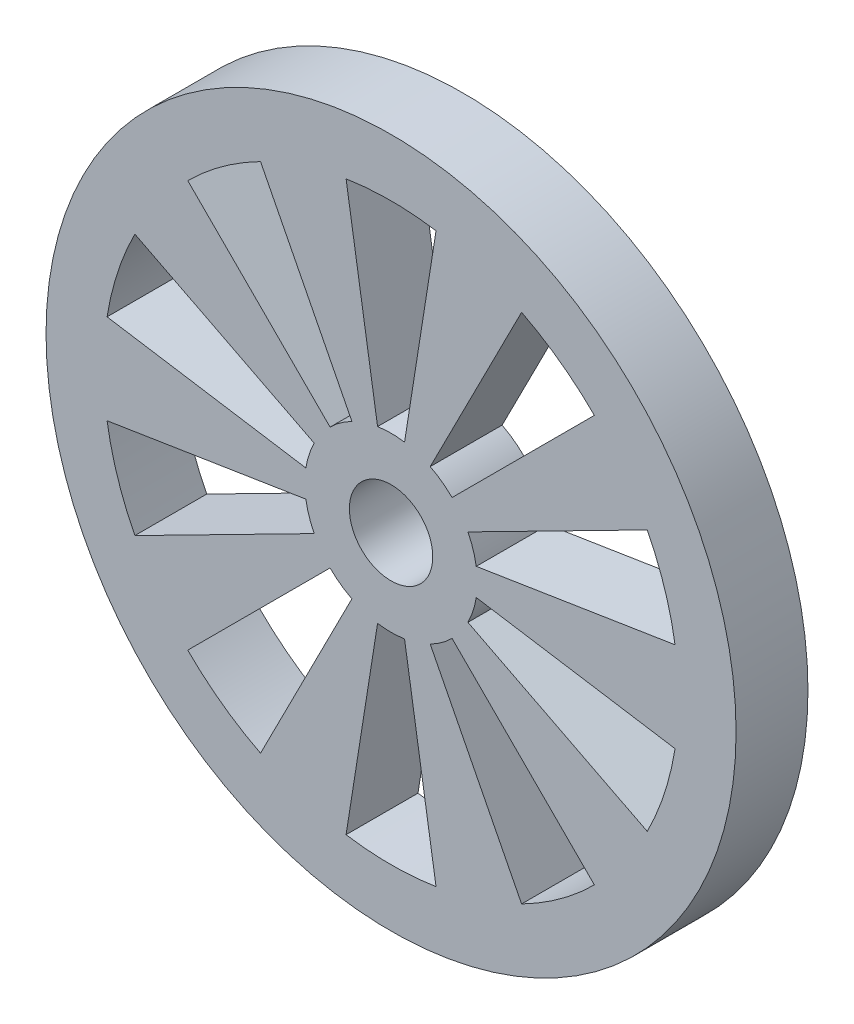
ISO-10303-21;
HEADER;
FILE_DESCRIPTION(('STEP AP214'),'2;1');
FILE_NAME('part.step','',(''),(''),'','','');
FILE_SCHEMA(('AUTOMOTIVE_DESIGN { 1 0 10303 214 1 1 1 1 }'));
ENDSEC;
DATA;
#1=APPLICATION_CONTEXT('core data for automotive mechanical design processes');
#2=APPLICATION_PROTOCOL_DEFINITION('international standard','automotive_design',2000,#1);
#3=PRODUCT_CONTEXT('',#1,'mechanical');
#4=PRODUCT('Part','Part','',(#3));
#5=PRODUCT_RELATED_PRODUCT_CATEGORY('part','',(#4));
#6=PRODUCT_DEFINITION_FORMATION('','',#4);
#7=PRODUCT_DEFINITION_CONTEXT('part definition',#1,'design');
#8=PRODUCT_DEFINITION('design','',#6,#7);
#9=PRODUCT_DEFINITION_SHAPE('','',#8);
#10=(LENGTH_UNIT() NAMED_UNIT(*) SI_UNIT(.MILLI.,.METRE.));
#11=(NAMED_UNIT(*) PLANE_ANGLE_UNIT() SI_UNIT($,.RADIAN.));
#12=(NAMED_UNIT(*) SI_UNIT($,.STERADIAN.) SOLID_ANGLE_UNIT());
#13=UNCERTAINTY_MEASURE_WITH_UNIT(LENGTH_MEASURE(1.E-05),#10,'distance_accuracy_value','');
#14=(GEOMETRIC_REPRESENTATION_CONTEXT(3) GLOBAL_UNCERTAINTY_ASSIGNED_CONTEXT((#13)) GLOBAL_UNIT_ASSIGNED_CONTEXT((#10,
#11,#12)) REPRESENTATION_CONTEXT('',''));
#15=CARTESIAN_POINT('',(0.,0.,0.));
#16=DIRECTION('',(0.,0.,1.));
#17=DIRECTION('',(1.,0.,0.));
#18=AXIS2_PLACEMENT_3D('',#15,#16,#17);
#19=CARTESIAN_POINT('',(0.,0.,1.25));
#20=DIRECTION('',(0.,0.,1.));
#21=DIRECTION('',(1.,0.,0.));
#22=AXIS2_PLACEMENT_3D('',#19,#20,#21);
#23=PLANE('',#22);
#24=DIRECTION('',(0.707106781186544,0.707106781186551,0.));
#25=VECTOR('',#24,1.);
#26=CARTESIAN_POINT('',(0.,0.,1.25));
#27=LINE('',#26,#25);
#28=CARTESIAN_POINT('',(2.12132034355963,2.12132034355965,1.25));
#29=VERTEX_POINT('',#28);
#30=CARTESIAN_POINT('',(7.07106781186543,7.07106781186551,1.25));
#31=VERTEX_POINT('',#30);
#32=EDGE_CURVE('E37',#29,#31,#27,.T.);
#33=ORIENTED_EDGE('',*,*,#32,.F.);
#34=CARTESIAN_POINT('',(0.,0.,1.25));
#35=DIRECTION('',(0.,0.,1.));
#36=DIRECTION('',(1.,0.,0.));
#37=AXIS2_PLACEMENT_3D('',#34,#35,#36);
#38=CIRCLE('',#37,3.);
#39=CARTESIAN_POINT('',(1.36197149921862,2.67301957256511,1.25));
#40=VERTEX_POINT('',#39);
#41=EDGE_CURVE('E79',#29,#40,#38,.T.);
#42=ORIENTED_EDGE('',*,*,#41,.T.);
#43=DIRECTION('',(0.453990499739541,0.891006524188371,0.));
#44=VECTOR('',#43,1.);
#45=CARTESIAN_POINT('',(1.36197149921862,2.67301957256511,1.25));
#46=LINE('',#45,#44);
#47=CARTESIAN_POINT('',(4.53990499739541,8.91006524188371,1.25));
#48=VERTEX_POINT('',#47);
#49=EDGE_CURVE('E257',#40,#48,#46,.T.);
#50=ORIENTED_EDGE('',*,*,#49,.T.);
#51=CARTESIAN_POINT('',(0.,0.,1.25));
#52=DIRECTION('',(0.,0.,1.));
#53=DIRECTION('',(1.,0.,0.));
#54=AXIS2_PLACEMENT_3D('',#51,#52,#53);
#55=CIRCLE('',#54,10.);
#56=EDGE_CURVE('E255',#31,#48,#55,.T.);
#57=ORIENTED_EDGE('',*,*,#56,.F.);
#58=EDGE_LOOP('',(#33,#42,#50,#57));
#59=FACE_BOUND('',#58,.T.);
#60=DIRECTION('',(0.156434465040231,0.987688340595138,0.));
#61=VECTOR('',#60,1.);
#62=CARTESIAN_POINT('',(0.,0.,1.25));
#63=LINE('',#62,#61);
#64=CARTESIAN_POINT('',(0.469303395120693,2.96306502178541,1.25));
#65=VERTEX_POINT('',#64);
#66=CARTESIAN_POINT('',(1.56434465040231,9.87688340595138,1.25));
#67=VERTEX_POINT('',#66);
#68=EDGE_CURVE('E243',#65,#67,#63,.T.);
#69=ORIENTED_EDGE('',*,*,#68,.F.);
#70=CARTESIAN_POINT('',(0.,0.,1.25));
#71=DIRECTION('',(0.,0.,1.));
#72=DIRECTION('',(1.,0.,0.));
#73=AXIS2_PLACEMENT_3D('',#70,#71,#72);
#74=CIRCLE('',#73,3.);
#75=CARTESIAN_POINT('',(-0.469303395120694,2.96306502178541,1.25));
#76=VERTEX_POINT('',#75);
#77=EDGE_CURVE('E233',#65,#76,#74,.T.);
#78=ORIENTED_EDGE('',*,*,#77,.T.);
#79=DIRECTION('',(-0.156434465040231,0.987688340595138,0.));
#80=VECTOR('',#79,1.);
#81=CARTESIAN_POINT('',(-0.469303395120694,2.96306502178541,1.25));
#82=LINE('',#81,#80);
#83=CARTESIAN_POINT('',(-1.56434465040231,9.87688340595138,1.25));
#84=VERTEX_POINT('',#83);
#85=EDGE_CURVE('E227',#76,#84,#82,.T.);
#86=ORIENTED_EDGE('',*,*,#85,.T.);
#87=CARTESIAN_POINT('',(0.,0.,1.25));
#88=DIRECTION('',(0.,0.,1.));
#89=DIRECTION('',(1.,0.,0.));
#90=AXIS2_PLACEMENT_3D('',#87,#88,#89);
#91=CIRCLE('',#90,10.);
#92=EDGE_CURVE('E254',#67,#84,#91,.T.);
#93=ORIENTED_EDGE('',*,*,#92,.F.);
#94=EDGE_LOOP('',(#69,#78,#86,#93));
#95=FACE_BOUND('',#94,.T.);
#96=DIRECTION('',(0.987688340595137,0.156434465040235,0.));
#97=VECTOR('',#96,1.);
#98=CARTESIAN_POINT('',(0.,0.,1.25));
#99=LINE('',#98,#97);
#100=CARTESIAN_POINT('',(2.96306502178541,0.469303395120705,1.25));
#101=VERTEX_POINT('',#100);
#102=CARTESIAN_POINT('',(9.87688340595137,1.56434465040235,1.25));
#103=VERTEX_POINT('',#102);
#104=EDGE_CURVE('E386',#101,#103,#99,.T.);
#105=ORIENTED_EDGE('',*,*,#104,.F.);
#106=CARTESIAN_POINT('',(0.,0.,1.25));
#107=DIRECTION('',(0.,0.,1.));
#108=DIRECTION('',(1.,0.,0.));
#109=AXIS2_PLACEMENT_3D('',#106,#107,#108);
#110=CIRCLE('',#109,3.);
#111=CARTESIAN_POINT('',(2.6730195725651,1.36197149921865,1.25));
#112=VERTEX_POINT('',#111);
#113=EDGE_CURVE('E383',#101,#112,#110,.T.);
#114=ORIENTED_EDGE('',*,*,#113,.T.);
#115=DIRECTION('',(0.891006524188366,0.453990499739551,0.));
#116=VECTOR('',#115,1.);
#117=CARTESIAN_POINT('',(2.6730195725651,1.36197149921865,1.25));
#118=LINE('',#117,#116);
#119=CARTESIAN_POINT('',(8.91006524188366,4.53990499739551,1.25));
#120=VERTEX_POINT('',#119);
#121=EDGE_CURVE('E380',#112,#120,#118,.T.);
#122=ORIENTED_EDGE('',*,*,#121,.T.);
#123=CARTESIAN_POINT('',(0.,0.,1.25));
#124=DIRECTION('',(0.,0.,1.));
#125=DIRECTION('',(1.,0.,0.));
#126=AXIS2_PLACEMENT_3D('',#123,#124,#125);
#127=CIRCLE('',#126,10.);
#128=EDGE_CURVE('E378',#103,#120,#127,.T.);
#129=ORIENTED_EDGE('',*,*,#128,.F.);
#130=EDGE_LOOP('',(#105,#114,#122,#129));
#131=FACE_BOUND('',#130,.T.);
#132=DIRECTION('',(0.891006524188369,-0.453990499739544,0.));
#133=VECTOR('',#132,1.);
#134=CARTESIAN_POINT('',(0.,0.,1.25));
#135=LINE('',#134,#133);
#136=CARTESIAN_POINT('',(2.67301957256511,-1.36197149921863,1.25));
#137=VERTEX_POINT('',#136);
#138=CARTESIAN_POINT('',(8.91006524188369,-4.53990499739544,1.25));
#139=VERTEX_POINT('',#138);
#140=EDGE_CURVE('E375',#137,#139,#135,.T.);
#141=ORIENTED_EDGE('',*,*,#140,.F.);
#142=CARTESIAN_POINT('',(0.,0.,1.25));
#143=DIRECTION('',(0.,0.,1.));
#144=DIRECTION('',(1.,0.,0.));
#145=AXIS2_PLACEMENT_3D('',#142,#143,#144);
#146=CIRCLE('',#145,3.);
#147=CARTESIAN_POINT('',(2.96306502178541,-0.469303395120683,1.25));
#148=VERTEX_POINT('',#147);
#149=EDGE_CURVE('E372',#137,#148,#146,.T.);
#150=ORIENTED_EDGE('',*,*,#149,.T.);
#151=DIRECTION('',(0.987688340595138,-0.156434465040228,0.));
#152=VECTOR('',#151,1.);
#153=CARTESIAN_POINT('',(2.96306502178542,-0.469303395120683,1.25));
#154=LINE('',#153,#152);
#155=CARTESIAN_POINT('',(9.87688340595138,-1.56434465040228,1.25));
#156=VERTEX_POINT('',#155);
#157=EDGE_CURVE('E369',#148,#156,#154,.T.);
#158=ORIENTED_EDGE('',*,*,#157,.T.);
#159=CARTESIAN_POINT('',(0.,0.,1.25));
#160=DIRECTION('',(0.,0.,1.));
#161=DIRECTION('',(1.,0.,0.));
#162=AXIS2_PLACEMENT_3D('',#159,#160,#161);
#163=CIRCLE('',#162,10.);
#164=EDGE_CURVE('E367',#139,#156,#163,.T.);
#165=ORIENTED_EDGE('',*,*,#164,.F.);
#166=EDGE_LOOP('',(#141,#150,#158,#165));
#167=FACE_BOUND('',#166,.T.);
#168=DIRECTION('',(-0.891006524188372,0.453990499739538,0.));
#169=VECTOR('',#168,1.);
#170=CARTESIAN_POINT('',(0.,0.,1.25));
#171=LINE('',#170,#169);
#172=CARTESIAN_POINT('',(-2.67301957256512,1.36197149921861,1.25));
#173=VERTEX_POINT('',#172);
#174=CARTESIAN_POINT('',(-8.91006524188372,4.53990499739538,1.25));
#175=VERTEX_POINT('',#174);
#176=EDGE_CURVE('E364',#173,#175,#171,.T.);
#177=ORIENTED_EDGE('',*,*,#176,.F.);
#178=CARTESIAN_POINT('',(0.,0.,1.25));
#179=DIRECTION('',(0.,0.,1.));
#180=DIRECTION('',(1.,0.,0.));
#181=AXIS2_PLACEMENT_3D('',#178,#179,#180);
#182=CIRCLE('',#181,3.);
#183=CARTESIAN_POINT('',(-2.96306502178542,0.469303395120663,1.25));
#184=VERTEX_POINT('',#183);
#185=EDGE_CURVE('E361',#173,#184,#182,.T.);
#186=ORIENTED_EDGE('',*,*,#185,.T.);
#187=DIRECTION('',(-0.987688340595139,0.156434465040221,0.));
#188=VECTOR('',#187,1.);
#189=CARTESIAN_POINT('',(-2.96306502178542,0.469303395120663,1.25));
#190=LINE('',#189,#188);
#191=CARTESIAN_POINT('',(-9.87688340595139,1.56434465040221,1.25));
#192=VERTEX_POINT('',#191);
#193=EDGE_CURVE('E358',#184,#192,#190,.T.);
#194=ORIENTED_EDGE('',*,*,#193,.T.);
#195=CARTESIAN_POINT('',(0.,0.,1.25));
#196=DIRECTION('',(0.,0.,1.));
#197=DIRECTION('',(1.,0.,0.));
#198=AXIS2_PLACEMENT_3D('',#195,#196,#197);
#199=CIRCLE('',#198,10.);
#200=EDGE_CURVE('E356',#175,#192,#199,.T.);
#201=ORIENTED_EDGE('',*,*,#200,.F.);
#202=EDGE_LOOP('',(#177,#186,#194,#201));
#203=FACE_BOUND('',#202,.T.);
#204=DIRECTION('',(-0.453990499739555,0.891006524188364,0.));
#205=VECTOR('',#204,1.);
#206=CARTESIAN_POINT('',(0.,0.,1.25));
#207=LINE('',#206,#205);
#208=CARTESIAN_POINT('',(-1.36197149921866,2.67301957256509,1.25));
#209=VERTEX_POINT('',#208);
#210=CARTESIAN_POINT('',(-4.53990499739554,8.91006524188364,1.25));
#211=VERTEX_POINT('',#210);
#212=EDGE_CURVE('E353',#209,#211,#207,.T.);
#213=ORIENTED_EDGE('',*,*,#212,.F.);
#214=CARTESIAN_POINT('',(0.,0.,1.25));
#215=DIRECTION('',(0.,0.,1.));
#216=DIRECTION('',(1.,0.,0.));
#217=AXIS2_PLACEMENT_3D('',#214,#215,#216);
#218=CIRCLE('',#217,3.);
#219=CARTESIAN_POINT('',(-2.12132034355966,2.12132034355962,1.25));
#220=VERTEX_POINT('',#219);
#221=EDGE_CURVE('E350',#209,#220,#218,.T.);
#222=ORIENTED_EDGE('',*,*,#221,.T.);
#223=DIRECTION('',(-0.707106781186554,0.707106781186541,0.));
#224=VECTOR('',#223,1.);
#225=CARTESIAN_POINT('',(-2.12132034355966,2.12132034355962,1.25));
#226=LINE('',#225,#224);
#227=CARTESIAN_POINT('',(-7.07106781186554,7.07106781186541,1.25));
#228=VERTEX_POINT('',#227);
#229=EDGE_CURVE('E347',#220,#228,#226,.T.);
#230=ORIENTED_EDGE('',*,*,#229,.T.);
#231=CARTESIAN_POINT('',(0.,0.,1.25));
#232=DIRECTION('',(0.,0.,1.));
#233=DIRECTION('',(1.,0.,0.));
#234=AXIS2_PLACEMENT_3D('',#231,#232,#233);
#235=CIRCLE('',#234,10.);
#236=EDGE_CURVE('E345',#211,#228,#235,.T.);
#237=ORIENTED_EDGE('',*,*,#236,.F.);
#238=EDGE_LOOP('',(#213,#222,#230,#237));
#239=FACE_BOUND('',#238,.T.);
#240=DIRECTION('',(-0.707106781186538,-0.707106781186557,0.));
#241=VECTOR('',#240,1.);
#242=CARTESIAN_POINT('',(0.,0.,1.25));
#243=LINE('',#242,#241);
#244=CARTESIAN_POINT('',(-2.12132034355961,-2.12132034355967,1.25));
#245=VERTEX_POINT('',#244);
#246=CARTESIAN_POINT('',(-7.07106781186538,-7.07106781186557,1.25));
#247=VERTEX_POINT('',#246);
#248=EDGE_CURVE('E342',#245,#247,#243,.T.);
#249=ORIENTED_EDGE('',*,*,#248,.F.);
#250=CARTESIAN_POINT('',(0.,0.,1.25));
#251=DIRECTION('',(0.,0.,1.));
#252=DIRECTION('',(1.,0.,0.));
#253=AXIS2_PLACEMENT_3D('',#250,#251,#252);
#254=CIRCLE('',#253,3.);
#255=CARTESIAN_POINT('',(-1.3619714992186,-2.67301957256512,1.25));
#256=VERTEX_POINT('',#255);
#257=EDGE_CURVE('E339',#245,#256,#254,.T.);
#258=ORIENTED_EDGE('',*,*,#257,.T.);
#259=DIRECTION('',(-0.453990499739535,-0.891006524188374,0.));
#260=VECTOR('',#259,1.);
#261=CARTESIAN_POINT('',(-1.3619714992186,-2.67301957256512,1.25));
#262=LINE('',#261,#260);
#263=CARTESIAN_POINT('',(-4.53990499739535,-8.91006524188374,1.25));
#264=VERTEX_POINT('',#263);
#265=EDGE_CURVE('E336',#256,#264,#262,.T.);
#266=ORIENTED_EDGE('',*,*,#265,.T.);
#267=CARTESIAN_POINT('',(0.,0.,1.25));
#268=DIRECTION('',(0.,0.,1.));
#269=DIRECTION('',(1.,0.,0.));
#270=AXIS2_PLACEMENT_3D('',#267,#268,#269);
#271=CIRCLE('',#270,10.);
#272=EDGE_CURVE('E334',#247,#264,#271,.T.);
#273=ORIENTED_EDGE('',*,*,#272,.F.);
#274=EDGE_LOOP('',(#249,#258,#266,#273));
#275=FACE_BOUND('',#274,.T.);
#276=DIRECTION('',(-0.987688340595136,-0.156434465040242,0.));
#277=VECTOR('',#276,1.);
#278=CARTESIAN_POINT('',(0.,0.,1.25));
#279=LINE('',#278,#277);
#280=CARTESIAN_POINT('',(-2.96306502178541,-0.469303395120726,1.25));
#281=VERTEX_POINT('',#280);
#282=CARTESIAN_POINT('',(-9.87688340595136,-1.56434465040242,1.25));
#283=VERTEX_POINT('',#282);
#284=EDGE_CURVE('E331',#281,#283,#279,.T.);
#285=ORIENTED_EDGE('',*,*,#284,.F.);
#286=CARTESIAN_POINT('',(0.,0.,1.25));
#287=DIRECTION('',(0.,0.,1.));
#288=DIRECTION('',(1.,0.,0.));
#289=AXIS2_PLACEMENT_3D('',#286,#287,#288);
#290=CIRCLE('',#289,3.);
#291=CARTESIAN_POINT('',(-2.67301957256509,-1.36197149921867,1.25));
#292=VERTEX_POINT('',#291);
#293=EDGE_CURVE('E328',#281,#292,#290,.T.);
#294=ORIENTED_EDGE('',*,*,#293,.T.);
#295=DIRECTION('',(-0.891006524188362,-0.453990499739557,0.));
#296=VECTOR('',#295,1.);
#297=CARTESIAN_POINT('',(-2.67301957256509,-1.36197149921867,1.25));
#298=LINE('',#297,#296);
#299=CARTESIAN_POINT('',(-8.91006524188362,-4.53990499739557,1.25));
#300=VERTEX_POINT('',#299);
#301=EDGE_CURVE('E325',#292,#300,#298,.T.);
#302=ORIENTED_EDGE('',*,*,#301,.T.);
#303=CARTESIAN_POINT('',(0.,0.,1.25));
#304=DIRECTION('',(0.,0.,1.));
#305=DIRECTION('',(1.,0.,0.));
#306=AXIS2_PLACEMENT_3D('',#303,#304,#305);
#307=CIRCLE('',#306,10.);
#308=EDGE_CURVE('E323',#283,#300,#307,.T.);
#309=ORIENTED_EDGE('',*,*,#308,.F.);
#310=EDGE_LOOP('',(#285,#294,#302,#309));
#311=FACE_BOUND('',#310,.T.);
#312=DIRECTION('',(0.453990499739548,-0.891006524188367,0.));
#313=VECTOR('',#312,1.);
#314=CARTESIAN_POINT('',(0.,0.,1.25));
#315=LINE('',#314,#313);
#316=CARTESIAN_POINT('',(1.36197149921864,-2.6730195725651,1.25));
#317=VERTEX_POINT('',#316);
#318=CARTESIAN_POINT('',(4.53990499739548,-8.91006524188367,1.25));
#319=VERTEX_POINT('',#318);
#320=EDGE_CURVE('E320',#317,#319,#315,.T.);
#321=ORIENTED_EDGE('',*,*,#320,.F.);
#322=CARTESIAN_POINT('',(0.,0.,1.25));
#323=DIRECTION('',(0.,0.,1.));
#324=DIRECTION('',(1.,0.,0.));
#325=AXIS2_PLACEMENT_3D('',#322,#323,#324);
#326=CIRCLE('',#325,3.);
#327=CARTESIAN_POINT('',(2.12132034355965,-2.12132034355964,1.25));
#328=VERTEX_POINT('',#327);
#329=EDGE_CURVE('E317',#317,#328,#326,.T.);
#330=ORIENTED_EDGE('',*,*,#329,.T.);
#331=DIRECTION('',(0.707106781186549,-0.707106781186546,0.));
#332=VECTOR('',#331,1.);
#333=CARTESIAN_POINT('',(2.12132034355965,-2.12132034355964,1.25));
#334=LINE('',#333,#332);
#335=CARTESIAN_POINT('',(7.07106781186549,-7.07106781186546,1.25));
#336=VERTEX_POINT('',#335);
#337=EDGE_CURVE('E313',#328,#336,#334,.T.);
#338=ORIENTED_EDGE('',*,*,#337,.T.);
#339=CARTESIAN_POINT('',(0.,0.,1.25));
#340=DIRECTION('',(0.,0.,1.));
#341=DIRECTION('',(1.,0.,0.));
#342=AXIS2_PLACEMENT_3D('',#339,#340,#341);
#343=CIRCLE('',#342,10.);
#344=EDGE_CURVE('E311',#319,#336,#343,.T.);
#345=ORIENTED_EDGE('',*,*,#344,.F.);
#346=EDGE_LOOP('',(#321,#330,#338,#345));
#347=FACE_BOUND('',#346,.T.);
#348=DIRECTION('',(-0.156434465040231,-0.987688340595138,0.));
#349=VECTOR('',#348,1.);
#350=CARTESIAN_POINT('',(0.,0.,1.25));
#351=LINE('',#350,#349);
#352=CARTESIAN_POINT('',(-0.469303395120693,-2.96306502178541,1.25));
#353=VERTEX_POINT('',#352);
#354=CARTESIAN_POINT('',(-1.56434465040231,-9.87688340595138,1.25));
#355=VERTEX_POINT('',#354);
#356=EDGE_CURVE('E299',#353,#355,#351,.T.);
#357=ORIENTED_EDGE('',*,*,#356,.F.);
#358=CARTESIAN_POINT('',(0.,0.,1.25));
#359=DIRECTION('',(0.,0.,1.));
#360=DIRECTION('',(1.,0.,0.));
#361=AXIS2_PLACEMENT_3D('',#358,#359,#360);
#362=CIRCLE('',#361,3.);
#363=CARTESIAN_POINT('',(0.469303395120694,-2.96306502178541,1.25));
#364=VERTEX_POINT('',#363);
#365=EDGE_CURVE('E307',#353,#364,#362,.T.);
#366=ORIENTED_EDGE('',*,*,#365,.T.);
#367=DIRECTION('',(0.156434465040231,-0.987688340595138,0.));
#368=VECTOR('',#367,1.);
#369=CARTESIAN_POINT('',(0.469303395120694,-2.96306502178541,1.25));
#370=LINE('',#369,#368);
#371=CARTESIAN_POINT('',(1.56434465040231,-9.87688340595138,1.25));
#372=VERTEX_POINT('',#371);
#373=EDGE_CURVE('E304',#364,#372,#370,.T.);
#374=ORIENTED_EDGE('',*,*,#373,.T.);
#375=CARTESIAN_POINT('',(0.,0.,1.25));
#376=DIRECTION('',(0.,0.,1.));
#377=DIRECTION('',(1.,0.,0.));
#378=AXIS2_PLACEMENT_3D('',#375,#376,#377);
#379=CIRCLE('',#378,10.);
#380=EDGE_CURVE('E286',#355,#372,#379,.T.);
#381=ORIENTED_EDGE('',*,*,#380,.F.);
#382=EDGE_LOOP('',(#357,#366,#374,#381));
#383=FACE_BOUND('',#382,.T.);
#384=CARTESIAN_POINT('',(0.,0.,1.25));
#385=DIRECTION('',(0.,0.,1.));
#386=DIRECTION('',(1.,0.,0.));
#387=AXIS2_PLACEMENT_3D('',#384,#385,#386);
#388=CIRCLE('',#387,12.);
#389=CARTESIAN_POINT('',(12.,0.,1.25));
#390=VERTEX_POINT('',#389);
#391=EDGE_CURVE('E11',#390,#390,#388,.T.);
#392=ORIENTED_EDGE('',*,*,#391,.T.);
#393=EDGE_LOOP('',(#392));
#394=FACE_BOUND('',#393,.T.);
#395=CARTESIAN_POINT('',(0.,0.,1.25));
#396=DIRECTION('',(0.,0.,1.));
#397=DIRECTION('',(1.,0.,0.));
#398=AXIS2_PLACEMENT_3D('',#395,#396,#397);
#399=CIRCLE('',#398,1.45);
#400=CARTESIAN_POINT('',(1.45,0.,1.25));
#401=VERTEX_POINT('',#400);
#402=EDGE_CURVE('E294',#401,#401,#399,.T.);
#403=ORIENTED_EDGE('',*,*,#402,.F.);
#404=EDGE_LOOP('',(#403));
#405=FACE_BOUND('',#404,.T.);
#406=ADVANCED_FACE('F33',(#59,#95,#131,#167,#203,#239,#275,#311,#347,#383,#394,#405),#23,.T.);
#407=CARTESIAN_POINT('',(0.,0.,-1.25));
#408=DIRECTION('',(0.,0.,1.));
#409=DIRECTION('',(1.,0.,0.));
#410=AXIS2_PLACEMENT_3D('',#407,#408,#409);
#411=PLANE('',#410);
#412=CARTESIAN_POINT('',(0.,0.,-1.25));
#413=DIRECTION('',(0.,0.,1.));
#414=DIRECTION('',(-0.809016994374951,0.587785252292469,0.));
#415=AXIS2_PLACEMENT_3D('',#412,#413,#414);
#416=CIRCLE('',#415,3.);
#417=CARTESIAN_POINT('',(2.12132034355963,2.12132034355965,-1.25));
#418=VERTEX_POINT('',#417);
#419=CARTESIAN_POINT('',(1.36197149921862,2.67301957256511,-1.25));
#420=VERTEX_POINT('',#419);
#421=EDGE_CURVE('E409',#418,#420,#416,.T.);
#422=ORIENTED_EDGE('',*,*,#421,.F.);
#423=DIRECTION('',(0.707106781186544,0.707106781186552,0.));
#424=VECTOR('',#423,1.);
#425=CARTESIAN_POINT('',(0.,0.,-1.25));
#426=LINE('',#425,#424);
#427=CARTESIAN_POINT('',(7.07106781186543,7.07106781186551,-1.25));
#428=VERTEX_POINT('',#427);
#429=EDGE_CURVE('E251',#418,#428,#426,.T.);
#430=ORIENTED_EDGE('',*,*,#429,.T.);
#431=CARTESIAN_POINT('',(0.,0.,-1.25));
#432=DIRECTION('',(0.,0.,1.));
#433=DIRECTION('',(-0.809016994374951,0.587785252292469,0.));
#434=AXIS2_PLACEMENT_3D('',#431,#432,#433);
#435=CIRCLE('',#434,10.);
#436=CARTESIAN_POINT('',(4.53990499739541,8.9100652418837,-1.25));
#437=VERTEX_POINT('',#436);
#438=EDGE_CURVE('E403',#428,#437,#435,.T.);
#439=ORIENTED_EDGE('',*,*,#438,.T.);
#440=DIRECTION('',(0.453990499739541,0.891006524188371,0.));
#441=VECTOR('',#440,1.);
#442=CARTESIAN_POINT('',(0.,0.,-1.25));
#443=LINE('',#442,#441);
#444=EDGE_CURVE('E406',#420,#437,#443,.T.);
#445=ORIENTED_EDGE('',*,*,#444,.F.);
#446=EDGE_LOOP('',(#422,#430,#439,#445));
#447=FACE_BOUND('',#446,.T.);
#448=CARTESIAN_POINT('',(0.,0.,-1.25));
#449=DIRECTION('',(0.,0.,1.));
#450=DIRECTION('',(-1.,0.,0.));
#451=AXIS2_PLACEMENT_3D('',#448,#449,#450);
#452=CIRCLE('',#451,3.);
#453=CARTESIAN_POINT('',(0.469303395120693,2.96306502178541,-1.25));
#454=VERTEX_POINT('',#453);
#455=CARTESIAN_POINT('',(-0.469303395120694,2.96306502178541,-1.25));
#456=VERTEX_POINT('',#455);
#457=EDGE_CURVE('E398',#454,#456,#452,.T.);
#458=ORIENTED_EDGE('',*,*,#457,.F.);
#459=DIRECTION('',(0.156434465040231,0.987688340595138,0.));
#460=VECTOR('',#459,1.);
#461=CARTESIAN_POINT('',(0.,0.,-1.25));
#462=LINE('',#461,#460);
#463=CARTESIAN_POINT('',(1.56434465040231,9.87688340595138,-1.25));
#464=VERTEX_POINT('',#463);
#465=EDGE_CURVE('E249',#454,#464,#462,.T.);
#466=ORIENTED_EDGE('',*,*,#465,.T.);
#467=CARTESIAN_POINT('',(0.,0.,-1.25));
#468=DIRECTION('',(0.,0.,1.));
#469=DIRECTION('',(-1.,0.,0.));
#470=AXIS2_PLACEMENT_3D('',#467,#468,#469);
#471=CIRCLE('',#470,10.);
#472=CARTESIAN_POINT('',(-1.56434465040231,9.87688340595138,-1.25));
#473=VERTEX_POINT('',#472);
#474=EDGE_CURVE('E673',#464,#473,#471,.T.);
#475=ORIENTED_EDGE('',*,*,#474,.T.);
#476=DIRECTION('',(-0.156434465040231,0.987688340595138,0.));
#477=VECTOR('',#476,1.);
#478=CARTESIAN_POINT('',(0.,0.,-1.25));
#479=LINE('',#478,#477);
#480=EDGE_CURVE('E394',#456,#473,#479,.T.);
#481=ORIENTED_EDGE('',*,*,#480,.F.);
#482=EDGE_LOOP('',(#458,#466,#475,#481));
#483=FACE_BOUND('',#482,.T.);
#484=CARTESIAN_POINT('',(0.,0.,-1.25));
#485=DIRECTION('',(0.,0.,1.));
#486=DIRECTION('',(-0.309016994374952,0.951056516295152,0.));
#487=AXIS2_PLACEMENT_3D('',#484,#485,#486);
#488=CIRCLE('',#487,3.);
#489=CARTESIAN_POINT('',(2.96306502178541,0.469303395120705,-1.25));
#490=VERTEX_POINT('',#489);
#491=CARTESIAN_POINT('',(2.6730195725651,1.36197149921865,-1.25));
#492=VERTEX_POINT('',#491);
#493=EDGE_CURVE('E454',#490,#492,#488,.T.);
#494=ORIENTED_EDGE('',*,*,#493,.F.);
#495=DIRECTION('',(0.987688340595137,0.156434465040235,0.));
#496=VECTOR('',#495,1.);
#497=CARTESIAN_POINT('',(0.,0.,-1.25));
#498=LINE('',#497,#496);
#499=CARTESIAN_POINT('',(9.87688340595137,1.56434465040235,-1.25));
#500=VERTEX_POINT('',#499);
#501=EDGE_CURVE('E414',#490,#500,#498,.T.);
#502=ORIENTED_EDGE('',*,*,#501,.T.);
#503=CARTESIAN_POINT('',(0.,0.,-1.25));
#504=DIRECTION('',(0.,0.,1.));
#505=DIRECTION('',(-0.309016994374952,0.951056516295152,0.));
#506=AXIS2_PLACEMENT_3D('',#503,#504,#505);
#507=CIRCLE('',#506,10.);
#508=CARTESIAN_POINT('',(8.91006524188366,4.53990499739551,-1.25));
#509=VERTEX_POINT('',#508);
#510=EDGE_CURVE('E448',#500,#509,#507,.T.);
#511=ORIENTED_EDGE('',*,*,#510,.T.);
#512=DIRECTION('',(0.891006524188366,0.453990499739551,0.));
#513=VECTOR('',#512,1.);
#514=CARTESIAN_POINT('',(0.,0.,-1.25));
#515=LINE('',#514,#513);
#516=EDGE_CURVE('E451',#492,#509,#515,.T.);
#517=ORIENTED_EDGE('',*,*,#516,.F.);
#518=EDGE_LOOP('',(#494,#502,#511,#517));
#519=FACE_BOUND('',#518,.T.);
#520=CARTESIAN_POINT('',(0.,0.,-1.25));
#521=DIRECTION('',(0.,0.,1.));
#522=DIRECTION('',(0.309016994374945,0.951056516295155,0.));
#523=AXIS2_PLACEMENT_3D('',#520,#521,#522);
#524=CIRCLE('',#523,3.);
#525=CARTESIAN_POINT('',(2.67301957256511,-1.36197149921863,-1.25));
#526=VERTEX_POINT('',#525);
#527=CARTESIAN_POINT('',(2.96306502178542,-0.469303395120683,-1.25));
#528=VERTEX_POINT('',#527);
#529=EDGE_CURVE('E431',#526,#528,#524,.T.);
#530=ORIENTED_EDGE('',*,*,#529,.F.);
#531=DIRECTION('',(0.891006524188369,-0.453990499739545,0.));
#532=VECTOR('',#531,1.);
#533=CARTESIAN_POINT('',(0.,0.,-1.25));
#534=LINE('',#533,#532);
#535=CARTESIAN_POINT('',(8.91006524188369,-4.53990499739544,-1.25));
#536=VERTEX_POINT('',#535);
#537=EDGE_CURVE('E421',#526,#536,#534,.T.);
#538=ORIENTED_EDGE('',*,*,#537,.T.);
#539=CARTESIAN_POINT('',(0.,0.,-1.25));
#540=DIRECTION('',(0.,0.,1.));
#541=DIRECTION('',(0.309016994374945,0.951056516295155,0.));
#542=AXIS2_PLACEMENT_3D('',#539,#540,#541);
#543=CIRCLE('',#542,10.);
#544=CARTESIAN_POINT('',(9.87688340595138,-1.56434465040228,-1.25));
#545=VERTEX_POINT('',#544);
#546=EDGE_CURVE('E424',#536,#545,#543,.T.);
#547=ORIENTED_EDGE('',*,*,#546,.T.);
#548=DIRECTION('',(0.987688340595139,-0.156434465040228,0.));
#549=VECTOR('',#548,1.);
#550=CARTESIAN_POINT('',(0.,0.,-1.25));
#551=LINE('',#550,#549);
#552=EDGE_CURVE('E428',#528,#545,#551,.T.);
#553=ORIENTED_EDGE('',*,*,#552,.F.);
#554=EDGE_LOOP('',(#530,#538,#547,#553));
#555=FACE_BOUND('',#554,.T.);
#556=CARTESIAN_POINT('',(0.,0.,-1.25));
#557=DIRECTION('',(0.,0.,1.));
#558=DIRECTION('',(-0.309016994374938,-0.951056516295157,0.));
#559=AXIS2_PLACEMENT_3D('',#556,#557,#558);
#560=CIRCLE('',#559,3.);
#561=CARTESIAN_POINT('',(-2.67301957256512,1.36197149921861,-1.25));
#562=VERTEX_POINT('',#561);
#563=CARTESIAN_POINT('',(-2.96306502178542,0.469303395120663,-1.25));
#564=VERTEX_POINT('',#563);
#565=EDGE_CURVE('E584',#562,#564,#560,.T.);
#566=ORIENTED_EDGE('',*,*,#565,.F.);
#567=DIRECTION('',(-0.891006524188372,0.453990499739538,0.));
#568=VECTOR('',#567,1.);
#569=CARTESIAN_POINT('',(0.,0.,-1.25));
#570=LINE('',#569,#568);
#571=CARTESIAN_POINT('',(-8.91006524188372,4.53990499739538,-1.25));
#572=VERTEX_POINT('',#571);
#573=EDGE_CURVE('E578',#562,#572,#570,.T.);
#574=ORIENTED_EDGE('',*,*,#573,.T.);
#575=CARTESIAN_POINT('',(0.,0.,-1.25));
#576=DIRECTION('',(0.,0.,1.));
#577=DIRECTION('',(-0.309016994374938,-0.951056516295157,0.));
#578=AXIS2_PLACEMENT_3D('',#575,#576,#577);
#579=CIRCLE('',#578,10.);
#580=CARTESIAN_POINT('',(-9.87688340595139,1.56434465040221,-1.25));
#581=VERTEX_POINT('',#580);
#582=EDGE_CURVE('E587',#572,#581,#579,.T.);
#583=ORIENTED_EDGE('',*,*,#582,.T.);
#584=DIRECTION('',(-0.987688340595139,0.156434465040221,0.));
#585=VECTOR('',#584,1.);
#586=CARTESIAN_POINT('',(0.,0.,-1.25));
#587=LINE('',#586,#585);
#588=EDGE_CURVE('E593',#564,#581,#587,.T.);
#589=ORIENTED_EDGE('',*,*,#588,.F.);
#590=EDGE_LOOP('',(#566,#574,#583,#589));
#591=FACE_BOUND('',#590,.T.);
#592=CARTESIAN_POINT('',(0.,0.,-1.25));
#593=DIRECTION('',(0.,0.,1.));
#594=DIRECTION('',(-0.809016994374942,-0.58778525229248,0.));
#595=AXIS2_PLACEMENT_3D('',#592,#593,#594);
#596=CIRCLE('',#595,3.);
#597=CARTESIAN_POINT('',(-1.36197149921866,2.67301957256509,-1.25));
#598=VERTEX_POINT('',#597);
#599=CARTESIAN_POINT('',(-2.12132034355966,2.12132034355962,-1.25));
#600=VERTEX_POINT('',#599);
#601=EDGE_CURVE('E619',#598,#600,#596,.T.);
#602=ORIENTED_EDGE('',*,*,#601,.F.);
#603=DIRECTION('',(-0.453990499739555,0.891006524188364,0.));
#604=VECTOR('',#603,1.);
#605=CARTESIAN_POINT('',(0.,0.,-1.25));
#606=LINE('',#605,#604);
#607=CARTESIAN_POINT('',(-4.53990499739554,8.91006524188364,-1.25));
#608=VERTEX_POINT('',#607);
#609=EDGE_CURVE('E606',#598,#608,#606,.T.);
#610=ORIENTED_EDGE('',*,*,#609,.T.);
#611=CARTESIAN_POINT('',(0.,0.,-1.25));
#612=DIRECTION('',(0.,0.,1.));
#613=DIRECTION('',(-0.809016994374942,-0.58778525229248,0.));
#614=AXIS2_PLACEMENT_3D('',#611,#612,#613);
#615=CIRCLE('',#614,10.);
#616=CARTESIAN_POINT('',(-7.07106781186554,7.07106781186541,-1.25));
#617=VERTEX_POINT('',#616);
#618=EDGE_CURVE('E613',#608,#617,#615,.T.);
#619=ORIENTED_EDGE('',*,*,#618,.T.);
#620=DIRECTION('',(-0.707106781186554,0.707106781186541,0.));
#621=VECTOR('',#620,1.);
#622=CARTESIAN_POINT('',(0.,0.,-1.25));
#623=LINE('',#622,#621);
#624=EDGE_CURVE('E616',#600,#617,#623,.T.);
#625=ORIENTED_EDGE('',*,*,#624,.F.);
#626=EDGE_LOOP('',(#602,#610,#619,#625));
#627=FACE_BOUND('',#626,.T.);
#628=CARTESIAN_POINT('',(0.,0.,-1.25));
#629=DIRECTION('',(0.,0.,1.));
#630=DIRECTION('',(0.809016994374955,-0.587785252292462,0.));
#631=AXIS2_PLACEMENT_3D('',#628,#629,#630);
#632=CIRCLE('',#631,3.);
#633=CARTESIAN_POINT('',(-2.12132034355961,-2.12132034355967,-1.25));
#634=VERTEX_POINT('',#633);
#635=CARTESIAN_POINT('',(-1.3619714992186,-2.67301957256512,-1.25));
#636=VERTEX_POINT('',#635);
#637=EDGE_CURVE('E641',#634,#636,#632,.T.);
#638=ORIENTED_EDGE('',*,*,#637,.F.);
#639=DIRECTION('',(-0.707106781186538,-0.707106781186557,0.));
#640=VECTOR('',#639,1.);
#641=CARTESIAN_POINT('',(0.,0.,-1.25));
#642=LINE('',#641,#640);
#643=CARTESIAN_POINT('',(-7.07106781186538,-7.07106781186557,-1.25));
#644=VERTEX_POINT('',#643);
#645=EDGE_CURVE('E632',#634,#644,#642,.T.);
#646=ORIENTED_EDGE('',*,*,#645,.T.);
#647=CARTESIAN_POINT('',(0.,0.,-1.25));
#648=DIRECTION('',(0.,0.,1.));
#649=DIRECTION('',(0.809016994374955,-0.587785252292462,0.));
#650=AXIS2_PLACEMENT_3D('',#647,#648,#649);
#651=CIRCLE('',#650,10.);
#652=CARTESIAN_POINT('',(-4.53990499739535,-8.91006524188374,-1.25));
#653=VERTEX_POINT('',#652);
#654=EDGE_CURVE('E635',#644,#653,#651,.T.);
#655=ORIENTED_EDGE('',*,*,#654,.T.);
#656=DIRECTION('',(-0.453990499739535,-0.891006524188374,0.));
#657=VECTOR('',#656,1.);
#658=CARTESIAN_POINT('',(0.,0.,-1.25));
#659=LINE('',#658,#657);
#660=EDGE_CURVE('E638',#636,#653,#659,.T.);
#661=ORIENTED_EDGE('',*,*,#660,.F.);
#662=EDGE_LOOP('',(#638,#646,#655,#661));
#663=FACE_BOUND('',#662,.T.);
#664=CARTESIAN_POINT('',(0.,0.,-1.25));
#665=DIRECTION('',(0.,0.,1.));
#666=DIRECTION('',(0.309016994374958,-0.95105651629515,0.));
#667=AXIS2_PLACEMENT_3D('',#664,#665,#666);
#668=CIRCLE('',#667,3.);
#669=CARTESIAN_POINT('',(-2.96306502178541,-0.469303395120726,-1.25));
#670=VERTEX_POINT('',#669);
#671=CARTESIAN_POINT('',(-2.67301957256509,-1.36197149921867,-1.25));
#672=VERTEX_POINT('',#671);
#673=EDGE_CURVE('E663',#670,#672,#668,.T.);
#674=ORIENTED_EDGE('',*,*,#673,.F.);
#675=DIRECTION('',(-0.987688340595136,-0.156434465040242,0.));
#676=VECTOR('',#675,1.);
#677=CARTESIAN_POINT('',(0.,0.,-1.25));
#678=LINE('',#677,#676);
#679=CARTESIAN_POINT('',(-9.87688340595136,-1.56434465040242,-1.25));
#680=VERTEX_POINT('',#679);
#681=EDGE_CURVE('E647',#670,#680,#678,.T.);
#682=ORIENTED_EDGE('',*,*,#681,.T.);
#683=CARTESIAN_POINT('',(0.,0.,-1.25));
#684=DIRECTION('',(0.,0.,1.));
#685=DIRECTION('',(0.309016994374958,-0.95105651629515,0.));
#686=AXIS2_PLACEMENT_3D('',#683,#684,#685);
#687=CIRCLE('',#686,10.);
#688=CARTESIAN_POINT('',(-8.91006524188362,-4.53990499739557,-1.25));
#689=VERTEX_POINT('',#688);
#690=EDGE_CURVE('E657',#680,#689,#687,.T.);
#691=ORIENTED_EDGE('',*,*,#690,.T.);
#692=DIRECTION('',(-0.891006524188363,-0.453990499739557,0.));
#693=VECTOR('',#692,1.);
#694=CARTESIAN_POINT('',(0.,0.,-1.25));
#695=LINE('',#694,#693);
#696=EDGE_CURVE('E660',#672,#689,#695,.T.);
#697=ORIENTED_EDGE('',*,*,#696,.F.);
#698=EDGE_LOOP('',(#674,#682,#691,#697));
#699=FACE_BOUND('',#698,.T.);
#700=CARTESIAN_POINT('',(0.,0.,-1.25));
#701=DIRECTION('',(0.,0.,1.));
#702=DIRECTION('',(0.809016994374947,0.587785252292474,0.));
#703=AXIS2_PLACEMENT_3D('',#700,#701,#702);
#704=CIRCLE('',#703,3.);
#705=CARTESIAN_POINT('',(1.36197149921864,-2.6730195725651,-1.25));
#706=VERTEX_POINT('',#705);
#707=CARTESIAN_POINT('',(2.12132034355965,-2.12132034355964,-1.25));
#708=VERTEX_POINT('',#707);
#709=EDGE_CURVE('E475',#706,#708,#704,.T.);
#710=ORIENTED_EDGE('',*,*,#709,.F.);
#711=DIRECTION('',(0.453990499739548,-0.891006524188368,0.));
#712=VECTOR('',#711,1.);
#713=CARTESIAN_POINT('',(0.,0.,-1.25));
#714=LINE('',#713,#712);
#715=CARTESIAN_POINT('',(4.53990499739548,-8.91006524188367,-1.25));
#716=VERTEX_POINT('',#715);
#717=EDGE_CURVE('E438',#706,#716,#714,.T.);
#718=ORIENTED_EDGE('',*,*,#717,.T.);
#719=CARTESIAN_POINT('',(0.,0.,-1.25));
#720=DIRECTION('',(0.,0.,1.));
#721=DIRECTION('',(0.809016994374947,0.587785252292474,0.));
#722=AXIS2_PLACEMENT_3D('',#719,#720,#721);
#723=CIRCLE('',#722,10.);
#724=CARTESIAN_POINT('',(7.07106781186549,-7.07106781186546,-1.25));
#725=VERTEX_POINT('',#724);
#726=EDGE_CURVE('E469',#716,#725,#723,.T.);
#727=ORIENTED_EDGE('',*,*,#726,.T.);
#728=DIRECTION('',(0.707106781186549,-0.707106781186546,0.));
#729=VECTOR('',#728,1.);
#730=CARTESIAN_POINT('',(0.,0.,-1.25));
#731=LINE('',#730,#729);
#732=EDGE_CURVE('E472',#708,#725,#731,.T.);
#733=ORIENTED_EDGE('',*,*,#732,.F.);
#734=EDGE_LOOP('',(#710,#718,#727,#733));
#735=FACE_BOUND('',#734,.T.);
#736=CARTESIAN_POINT('',(0.,0.,-1.25));
#737=DIRECTION('',(0.,0.,1.));
#738=DIRECTION('',(1.,0.,0.));
#739=AXIS2_PLACEMENT_3D('',#736,#737,#738);
#740=CIRCLE('',#739,3.);
#741=CARTESIAN_POINT('',(-0.469303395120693,-2.96306502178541,-1.25));
#742=VERTEX_POINT('',#741);
#743=CARTESIAN_POINT('',(0.469303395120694,-2.96306502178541,-1.25));
#744=VERTEX_POINT('',#743);
#745=EDGE_CURVE('E281',#742,#744,#740,.T.);
#746=ORIENTED_EDGE('',*,*,#745,.F.);
#747=DIRECTION('',(-0.156434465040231,-0.987688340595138,0.));
#748=VECTOR('',#747,1.);
#749=CARTESIAN_POINT('',(0.,0.,-1.25));
#750=LINE('',#749,#748);
#751=CARTESIAN_POINT('',(-1.56434465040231,-9.87688340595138,-1.25));
#752=VERTEX_POINT('',#751);
#753=EDGE_CURVE('E264',#742,#752,#750,.T.);
#754=ORIENTED_EDGE('',*,*,#753,.T.);
#755=CARTESIAN_POINT('',(0.,0.,-1.25));
#756=DIRECTION('',(0.,0.,1.));
#757=DIRECTION('',(1.,0.,0.));
#758=AXIS2_PLACEMENT_3D('',#755,#756,#757);
#759=CIRCLE('',#758,10.);
#760=CARTESIAN_POINT('',(1.56434465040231,-9.87688340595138,-1.25));
#761=VERTEX_POINT('',#760);
#762=EDGE_CURVE('E268',#752,#761,#759,.T.);
#763=ORIENTED_EDGE('',*,*,#762,.T.);
#764=DIRECTION('',(0.156434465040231,-0.987688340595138,0.));
#765=VECTOR('',#764,1.);
#766=CARTESIAN_POINT('',(0.,0.,-1.25));
#767=LINE('',#766,#765);
#768=EDGE_CURVE('E273',#744,#761,#767,.T.);
#769=ORIENTED_EDGE('',*,*,#768,.F.);
#770=EDGE_LOOP('',(#746,#754,#763,#769));
#771=FACE_BOUND('',#770,.T.);
#772=CARTESIAN_POINT('',(0.,0.,-1.25));
#773=DIRECTION('',(0.,0.,1.));
#774=DIRECTION('',(1.,0.,0.));
#775=AXIS2_PLACEMENT_3D('',#772,#773,#774);
#776=CIRCLE('',#775,12.);
#777=CARTESIAN_POINT('',(12.,0.,-1.25));
#778=VERTEX_POINT('',#777);
#779=EDGE_CURVE('E42',#778,#778,#776,.T.);
#780=ORIENTED_EDGE('',*,*,#779,.F.);
#781=EDGE_LOOP('',(#780));
#782=FACE_BOUND('',#781,.T.);
#783=CARTESIAN_POINT('',(0.,0.,-1.25));
#784=DIRECTION('',(0.,0.,1.));
#785=DIRECTION('',(1.,0.,0.));
#786=AXIS2_PLACEMENT_3D('',#783,#784,#785);
#787=CIRCLE('',#786,1.45);
#788=CARTESIAN_POINT('',(1.45,0.,-1.25));
#789=VERTEX_POINT('',#788);
#790=EDGE_CURVE('E297',#789,#789,#787,.T.);
#791=ORIENTED_EDGE('',*,*,#790,.T.);
#792=EDGE_LOOP('',(#791));
#793=FACE_BOUND('',#792,.T.);
#794=ADVANCED_FACE('F506',(#447,#483,#519,#555,#591,#627,#663,#699,#735,#771,#782,#793),#411,.F.);
#795=CARTESIAN_POINT('',(0.,0.,1.25));
#796=DIRECTION('',(0.,0.,-1.));
#797=DIRECTION('',(-1.,0.,0.));
#798=AXIS2_PLACEMENT_3D('',#795,#796,#797);
#799=CYLINDRICAL_SURFACE('',#798,12.);
#800=ORIENTED_EDGE('',*,*,#391,.F.);
#801=EDGE_LOOP('',(#800));
#802=FACE_BOUND('',#801,.T.);
#803=ORIENTED_EDGE('',*,*,#779,.T.);
#804=EDGE_LOOP('',(#803));
#805=FACE_BOUND('',#804,.T.);
#806=ADVANCED_FACE('F35',(#802,#805),#799,.T.);
#807=CARTESIAN_POINT('',(0.,0.,1.25));
#808=DIRECTION('',(0.,0.,-1.));
#809=DIRECTION('',(-1.,0.,0.));
#810=AXIS2_PLACEMENT_3D('',#807,#808,#809);
#811=CYLINDRICAL_SURFACE('',#810,1.45);
#812=ORIENTED_EDGE('',*,*,#402,.T.);
#813=EDGE_LOOP('',(#812));
#814=FACE_BOUND('',#813,.T.);
#815=ORIENTED_EDGE('',*,*,#790,.F.);
#816=EDGE_LOOP('',(#815));
#817=FACE_BOUND('',#816,.T.);
#818=ADVANCED_FACE('F717',(#814,#817),#811,.F.);
#819=CARTESIAN_POINT('',(0.,0.,-1.25));
#820=DIRECTION('',(-0.987688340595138,0.156434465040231,0.));
#821=DIRECTION('',(-0.156434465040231,-0.987688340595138,0.));
#822=AXIS2_PLACEMENT_3D('',#819,#820,#821);
#823=PLANE('',#822);
#824=ORIENTED_EDGE('',*,*,#356,.T.);
#825=DIRECTION('',(0.,0.,1.));
#826=VECTOR('',#825,1.);
#827=CARTESIAN_POINT('',(-1.56434465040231,-9.87688340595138,-1.25));
#828=LINE('',#827,#826);
#829=EDGE_CURVE('E88',#752,#355,#828,.T.);
#830=ORIENTED_EDGE('',*,*,#829,.F.);
#831=ORIENTED_EDGE('',*,*,#753,.F.);
#832=DIRECTION('',(0.,0.,1.));
#833=VECTOR('',#832,1.);
#834=CARTESIAN_POINT('',(-0.469303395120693,-2.96306502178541,-1.25));
#835=LINE('',#834,#833);
#836=EDGE_CURVE('E283',#742,#353,#835,.T.);
#837=ORIENTED_EDGE('',*,*,#836,.T.);
#838=EDGE_LOOP('',(#824,#830,#831,#837));
#839=FACE_BOUND('',#838,.T.);
#840=ADVANCED_FACE('F720',(#839),#823,.F.);
#841=CARTESIAN_POINT('',(0.,0.,-1.25));
#842=DIRECTION('',(0.,0.,1.));
#843=DIRECTION('',(1.,0.,0.));
#844=AXIS2_PLACEMENT_3D('',#841,#842,#843);
#845=CYLINDRICAL_SURFACE('',#844,3.);
#846=ORIENTED_EDGE('',*,*,#836,.F.);
#847=ORIENTED_EDGE('',*,*,#745,.T.);
#848=DIRECTION('',(0.,0.,1.));
#849=VECTOR('',#848,1.);
#850=CARTESIAN_POINT('',(0.469303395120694,-2.96306502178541,-1.25));
#851=LINE('',#850,#849);
#852=EDGE_CURVE('E287',#744,#364,#851,.T.);
#853=ORIENTED_EDGE('',*,*,#852,.T.);
#854=ORIENTED_EDGE('',*,*,#365,.F.);
#855=EDGE_LOOP('',(#846,#847,#853,#854));
#856=FACE_BOUND('',#855,.T.);
#857=ADVANCED_FACE('F724',(#856),#845,.T.);
#858=CARTESIAN_POINT('',(0.,0.,-1.25));
#859=DIRECTION('',(-0.987688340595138,-0.156434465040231,0.));
#860=DIRECTION('',(0.156434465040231,-0.987688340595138,0.));
#861=AXIS2_PLACEMENT_3D('',#858,#859,#860);
#862=PLANE('',#861);
#863=ORIENTED_EDGE('',*,*,#852,.F.);
#864=ORIENTED_EDGE('',*,*,#768,.T.);
#865=DIRECTION('',(0.,0.,1.));
#866=VECTOR('',#865,1.);
#867=CARTESIAN_POINT('',(1.56434465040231,-9.87688340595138,-1.25));
#868=LINE('',#867,#866);
#869=EDGE_CURVE('E290',#761,#372,#868,.T.);
#870=ORIENTED_EDGE('',*,*,#869,.T.);
#871=ORIENTED_EDGE('',*,*,#373,.F.);
#872=EDGE_LOOP('',(#863,#864,#870,#871));
#873=FACE_BOUND('',#872,.T.);
#874=ADVANCED_FACE('F728',(#873),#862,.T.);
#875=CARTESIAN_POINT('',(0.,0.,-1.25));
#876=DIRECTION('',(0.,0.,1.));
#877=DIRECTION('',(1.,0.,0.));
#878=AXIS2_PLACEMENT_3D('',#875,#876,#877);
#879=CYLINDRICAL_SURFACE('',#878,10.);
#880=ORIENTED_EDGE('',*,*,#380,.T.);
#881=ORIENTED_EDGE('',*,*,#869,.F.);
#882=ORIENTED_EDGE('',*,*,#762,.F.);
#883=ORIENTED_EDGE('',*,*,#829,.T.);
#884=EDGE_LOOP('',(#880,#881,#882,#883));
#885=FACE_BOUND('',#884,.T.);
#886=ADVANCED_FACE('F725',(#885),#879,.F.);
#887=CARTESIAN_POINT('',(0.,0.,-1.25));
#888=DIRECTION('',(-0.891006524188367,-0.453990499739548,0.));
#889=DIRECTION('',(0.453990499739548,-0.891006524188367,0.));
#890=AXIS2_PLACEMENT_3D('',#887,#888,#889);
#891=PLANE('',#890);
#892=ORIENTED_EDGE('',*,*,#320,.T.);
#893=DIRECTION('',(0.,0.,1.));
#894=VECTOR('',#893,1.);
#895=CARTESIAN_POINT('',(4.53990499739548,-8.91006524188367,-1.25));
#896=LINE('',#895,#894);
#897=EDGE_CURVE('E276',#716,#319,#896,.T.);
#898=ORIENTED_EDGE('',*,*,#897,.F.);
#899=ORIENTED_EDGE('',*,*,#717,.F.);
#900=DIRECTION('',(0.,0.,1.));
#901=VECTOR('',#900,1.);
#902=CARTESIAN_POINT('',(1.36197149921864,-2.6730195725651,-1.25));
#903=LINE('',#902,#901);
#904=EDGE_CURVE('E314',#706,#317,#903,.T.);
#905=ORIENTED_EDGE('',*,*,#904,.T.);
#906=EDGE_LOOP('',(#892,#898,#899,#905));
#907=FACE_BOUND('',#906,.T.);
#908=ADVANCED_FACE('F494',(#907),#891,.F.);
#909=CARTESIAN_POINT('',(0.,0.,-1.25));
#910=DIRECTION('',(0.,0.,1.));
#911=DIRECTION('',(1.,0.,0.));
#912=AXIS2_PLACEMENT_3D('',#909,#910,#911);
#913=CYLINDRICAL_SURFACE('',#912,3.);
#914=ORIENTED_EDGE('',*,*,#904,.F.);
#915=ORIENTED_EDGE('',*,*,#709,.T.);
#916=DIRECTION('',(0.,0.,1.));
#917=VECTOR('',#916,1.);
#918=CARTESIAN_POINT('',(2.12132034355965,-2.12132034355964,-1.25));
#919=LINE('',#918,#917);
#920=EDGE_CURVE('E480',#708,#328,#919,.T.);
#921=ORIENTED_EDGE('',*,*,#920,.T.);
#922=ORIENTED_EDGE('',*,*,#329,.F.);
#923=EDGE_LOOP('',(#914,#915,#921,#922));
#924=FACE_BOUND('',#923,.T.);
#925=ADVANCED_FACE('F503',(#924),#913,.T.);
#926=CARTESIAN_POINT('',(0.,0.,-1.25));
#927=DIRECTION('',(-0.707106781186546,-0.707106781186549,0.));
#928=DIRECTION('',(0.707106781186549,-0.707106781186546,0.));
#929=AXIS2_PLACEMENT_3D('',#926,#927,#928);
#930=PLANE('',#929);
#931=ORIENTED_EDGE('',*,*,#920,.F.);
#932=ORIENTED_EDGE('',*,*,#732,.T.);
#933=DIRECTION('',(0.,0.,1.));
#934=VECTOR('',#933,1.);
#935=CARTESIAN_POINT('',(7.07106781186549,-7.07106781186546,-1.25));
#936=LINE('',#935,#934);
#937=EDGE_CURVE('E482',#725,#336,#936,.T.);
#938=ORIENTED_EDGE('',*,*,#937,.T.);
#939=ORIENTED_EDGE('',*,*,#337,.F.);
#940=EDGE_LOOP('',(#931,#932,#938,#939));
#941=FACE_BOUND('',#940,.T.);
#942=ADVANCED_FACE('F499',(#941),#930,.T.);
#943=CARTESIAN_POINT('',(0.,0.,-1.25));
#944=DIRECTION('',(0.,0.,1.));
#945=DIRECTION('',(1.,0.,0.));
#946=AXIS2_PLACEMENT_3D('',#943,#944,#945);
#947=CYLINDRICAL_SURFACE('',#946,10.);
#948=ORIENTED_EDGE('',*,*,#344,.T.);
#949=ORIENTED_EDGE('',*,*,#937,.F.);
#950=ORIENTED_EDGE('',*,*,#726,.F.);
#951=ORIENTED_EDGE('',*,*,#897,.T.);
#952=EDGE_LOOP('',(#948,#949,#950,#951));
#953=FACE_BOUND('',#952,.T.);
#954=ADVANCED_FACE('F488',(#953),#947,.F.);
#955=CARTESIAN_POINT('',(0.,0.,-1.25));
#956=DIRECTION('',(-0.156434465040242,0.987688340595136,0.));
#957=DIRECTION('',(-0.987688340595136,-0.156434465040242,0.));
#958=AXIS2_PLACEMENT_3D('',#955,#956,#957);
#959=PLANE('',#958);
#960=ORIENTED_EDGE('',*,*,#284,.T.);
#961=DIRECTION('',(0.,0.,1.));
#962=VECTOR('',#961,1.);
#963=CARTESIAN_POINT('',(-9.87688340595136,-1.56434465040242,-1.25));
#964=LINE('',#963,#962);
#965=EDGE_CURVE('E664',#680,#283,#964,.T.);
#966=ORIENTED_EDGE('',*,*,#965,.F.);
#967=ORIENTED_EDGE('',*,*,#681,.F.);
#968=DIRECTION('',(0.,0.,1.));
#969=VECTOR('',#968,1.);
#970=CARTESIAN_POINT('',(-2.96306502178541,-0.469303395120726,-1.25));
#971=LINE('',#970,#969);
#972=EDGE_CURVE('E596',#670,#281,#971,.T.);
#973=ORIENTED_EDGE('',*,*,#972,.T.);
#974=EDGE_LOOP('',(#960,#966,#967,#973));
#975=FACE_BOUND('',#974,.T.);
#976=ADVANCED_FACE('F740',(#975),#959,.F.);
#977=CARTESIAN_POINT('',(0.,0.,-1.25));
#978=DIRECTION('',(0.,0.,1.));
#979=DIRECTION('',(1.,0.,0.));
#980=AXIS2_PLACEMENT_3D('',#977,#978,#979);
#981=CYLINDRICAL_SURFACE('',#980,3.);
#982=ORIENTED_EDGE('',*,*,#972,.F.);
#983=ORIENTED_EDGE('',*,*,#673,.T.);
#984=DIRECTION('',(0.,0.,1.));
#985=VECTOR('',#984,1.);
#986=CARTESIAN_POINT('',(-2.67301957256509,-1.36197149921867,-1.25));
#987=LINE('',#986,#985);
#988=EDGE_CURVE('E599',#672,#292,#987,.T.);
#989=ORIENTED_EDGE('',*,*,#988,.T.);
#990=ORIENTED_EDGE('',*,*,#293,.F.);
#991=EDGE_LOOP('',(#982,#983,#989,#990));
#992=FACE_BOUND('',#991,.T.);
#993=ADVANCED_FACE('F806',(#992),#981,.T.);
#994=CARTESIAN_POINT('',(0.,0.,-1.25));
#995=DIRECTION('',(-0.453990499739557,0.891006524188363,0.));
#996=DIRECTION('',(-0.891006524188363,-0.453990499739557,0.));
#997=AXIS2_PLACEMENT_3D('',#994,#995,#996);
#998=PLANE('',#997);
#999=ORIENTED_EDGE('',*,*,#988,.F.);
#1000=ORIENTED_EDGE('',*,*,#696,.T.);
#1001=DIRECTION('',(0.,0.,1.));
#1002=VECTOR('',#1001,1.);
#1003=CARTESIAN_POINT('',(-8.91006524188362,-4.53990499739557,-1.25));
#1004=LINE('',#1003,#1002);
#1005=EDGE_CURVE('E668',#689,#300,#1004,.T.);
#1006=ORIENTED_EDGE('',*,*,#1005,.T.);
#1007=ORIENTED_EDGE('',*,*,#301,.F.);
#1008=EDGE_LOOP('',(#999,#1000,#1006,#1007));
#1009=FACE_BOUND('',#1008,.T.);
#1010=ADVANCED_FACE('F809',(#1009),#998,.T.);
#1011=CARTESIAN_POINT('',(0.,0.,-1.25));
#1012=DIRECTION('',(0.,0.,1.));
#1013=DIRECTION('',(1.,0.,0.));
#1014=AXIS2_PLACEMENT_3D('',#1011,#1012,#1013);
#1015=CYLINDRICAL_SURFACE('',#1014,10.);
#1016=ORIENTED_EDGE('',*,*,#308,.T.);
#1017=ORIENTED_EDGE('',*,*,#1005,.F.);
#1018=ORIENTED_EDGE('',*,*,#690,.F.);
#1019=ORIENTED_EDGE('',*,*,#965,.T.);
#1020=EDGE_LOOP('',(#1016,#1017,#1018,#1019));
#1021=FACE_BOUND('',#1020,.T.);
#1022=ADVANCED_FACE('F804',(#1021),#1015,.F.);
#1023=CARTESIAN_POINT('',(0.,0.,-1.25));
#1024=DIRECTION('',(-0.707106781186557,0.707106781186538,0.));
#1025=DIRECTION('',(-0.707106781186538,-0.707106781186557,0.));
#1026=AXIS2_PLACEMENT_3D('',#1023,#1024,#1025);
#1027=PLANE('',#1026);
#1028=ORIENTED_EDGE('',*,*,#248,.T.);
#1029=DIRECTION('',(0.,0.,1.));
#1030=VECTOR('',#1029,1.);
#1031=CARTESIAN_POINT('',(-7.07106781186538,-7.07106781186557,-1.25));
#1032=LINE('',#1031,#1030);
#1033=EDGE_CURVE('E643',#644,#247,#1032,.T.);
#1034=ORIENTED_EDGE('',*,*,#1033,.F.);
#1035=ORIENTED_EDGE('',*,*,#645,.F.);
#1036=DIRECTION('',(0.,0.,1.));
#1037=VECTOR('',#1036,1.);
#1038=CARTESIAN_POINT('',(-2.12132034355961,-2.12132034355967,-1.25));
#1039=LINE('',#1038,#1037);
#1040=EDGE_CURVE('E644',#634,#245,#1039,.T.);
#1041=ORIENTED_EDGE('',*,*,#1040,.T.);
#1042=EDGE_LOOP('',(#1028,#1034,#1035,#1041));
#1043=FACE_BOUND('',#1042,.T.);
#1044=ADVANCED_FACE('F794',(#1043),#1027,.F.);
#1045=CARTESIAN_POINT('',(0.,0.,-1.25));
#1046=DIRECTION('',(0.,0.,1.));
#1047=DIRECTION('',(1.,0.,0.));
#1048=AXIS2_PLACEMENT_3D('',#1045,#1046,#1047);
#1049=CYLINDRICAL_SURFACE('',#1048,3.);
#1050=ORIENTED_EDGE('',*,*,#1040,.F.);
#1051=ORIENTED_EDGE('',*,*,#637,.T.);
#1052=DIRECTION('',(0.,0.,1.));
#1053=VECTOR('',#1052,1.);
#1054=CARTESIAN_POINT('',(-1.3619714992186,-2.67301957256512,-1.25));
#1055=LINE('',#1054,#1053);
#1056=EDGE_CURVE('E648',#636,#256,#1055,.T.);
#1057=ORIENTED_EDGE('',*,*,#1056,.T.);
#1058=ORIENTED_EDGE('',*,*,#257,.F.);
#1059=EDGE_LOOP('',(#1050,#1051,#1057,#1058));
#1060=FACE_BOUND('',#1059,.T.);
#1061=ADVANCED_FACE('F790',(#1060),#1049,.T.);
#1062=CARTESIAN_POINT('',(0.,0.,-1.25));
#1063=DIRECTION('',(-0.891006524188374,0.453990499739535,0.));
#1064=DIRECTION('',(-0.453990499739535,-0.891006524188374,0.));
#1065=AXIS2_PLACEMENT_3D('',#1062,#1063,#1064);
#1066=PLANE('',#1065);
#1067=ORIENTED_EDGE('',*,*,#1056,.F.);
#1068=ORIENTED_EDGE('',*,*,#660,.T.);
#1069=DIRECTION('',(0.,0.,1.));
#1070=VECTOR('',#1069,1.);
#1071=CARTESIAN_POINT('',(-4.53990499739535,-8.91006524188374,-1.25));
#1072=LINE('',#1071,#1070);
#1073=EDGE_CURVE('E651',#653,#264,#1072,.T.);
#1074=ORIENTED_EDGE('',*,*,#1073,.T.);
#1075=ORIENTED_EDGE('',*,*,#265,.F.);
#1076=EDGE_LOOP('',(#1067,#1068,#1074,#1075));
#1077=FACE_BOUND('',#1076,.T.);
#1078=ADVANCED_FACE('F793',(#1077),#1066,.T.);
#1079=CARTESIAN_POINT('',(0.,0.,-1.25));
#1080=DIRECTION('',(0.,0.,1.));
#1081=DIRECTION('',(1.,0.,0.));
#1082=AXIS2_PLACEMENT_3D('',#1079,#1080,#1081);
#1083=CYLINDRICAL_SURFACE('',#1082,10.);
#1084=ORIENTED_EDGE('',*,*,#272,.T.);
#1085=ORIENTED_EDGE('',*,*,#1073,.F.);
#1086=ORIENTED_EDGE('',*,*,#654,.F.);
#1087=ORIENTED_EDGE('',*,*,#1033,.T.);
#1088=EDGE_LOOP('',(#1084,#1085,#1086,#1087));
#1089=FACE_BOUND('',#1088,.T.);
#1090=ADVANCED_FACE('F788',(#1089),#1083,.F.);
#1091=CARTESIAN_POINT('',(0.,0.,-1.25));
#1092=DIRECTION('',(0.891006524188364,0.453990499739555,0.));
#1093=DIRECTION('',(-0.453990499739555,0.891006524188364,0.));
#1094=AXIS2_PLACEMENT_3D('',#1091,#1092,#1093);
#1095=PLANE('',#1094);
#1096=ORIENTED_EDGE('',*,*,#212,.T.);
#1097=DIRECTION('',(0.,0.,1.));
#1098=VECTOR('',#1097,1.);
#1099=CARTESIAN_POINT('',(-4.53990499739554,8.91006524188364,-1.25));
#1100=LINE('',#1099,#1098);
#1101=EDGE_CURVE('E621',#608,#211,#1100,.T.);
#1102=ORIENTED_EDGE('',*,*,#1101,.F.);
#1103=ORIENTED_EDGE('',*,*,#609,.F.);
#1104=DIRECTION('',(0.,0.,1.));
#1105=VECTOR('',#1104,1.);
#1106=CARTESIAN_POINT('',(-1.36197149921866,2.67301957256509,-1.25));
#1107=LINE('',#1106,#1105);
#1108=EDGE_CURVE('E622',#598,#209,#1107,.T.);
#1109=ORIENTED_EDGE('',*,*,#1108,.T.);
#1110=EDGE_LOOP('',(#1096,#1102,#1103,#1109));
#1111=FACE_BOUND('',#1110,.T.);
#1112=ADVANCED_FACE('F778',(#1111),#1095,.F.);
#1113=CARTESIAN_POINT('',(0.,0.,-1.25));
#1114=DIRECTION('',(0.,0.,1.));
#1115=DIRECTION('',(1.,0.,0.));
#1116=AXIS2_PLACEMENT_3D('',#1113,#1114,#1115);
#1117=CYLINDRICAL_SURFACE('',#1116,3.);
#1118=ORIENTED_EDGE('',*,*,#1108,.F.);
#1119=ORIENTED_EDGE('',*,*,#601,.T.);
#1120=DIRECTION('',(0.,0.,1.));
#1121=VECTOR('',#1120,1.);
#1122=CARTESIAN_POINT('',(-2.12132034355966,2.12132034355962,-1.25));
#1123=LINE('',#1122,#1121);
#1124=EDGE_CURVE('E625',#600,#220,#1123,.T.);
#1125=ORIENTED_EDGE('',*,*,#1124,.T.);
#1126=ORIENTED_EDGE('',*,*,#221,.F.);
#1127=EDGE_LOOP('',(#1118,#1119,#1125,#1126));
#1128=FACE_BOUND('',#1127,.T.);
#1129=ADVANCED_FACE('F774',(#1128),#1117,.T.);
#1130=CARTESIAN_POINT('',(0.,0.,-1.25));
#1131=DIRECTION('',(0.707106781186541,0.707106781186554,0.));
#1132=DIRECTION('',(-0.707106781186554,0.707106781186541,0.));
#1133=AXIS2_PLACEMENT_3D('',#1130,#1131,#1132);
#1134=PLANE('',#1133);
#1135=ORIENTED_EDGE('',*,*,#1124,.F.);
#1136=ORIENTED_EDGE('',*,*,#624,.T.);
#1137=DIRECTION('',(0.,0.,1.));
#1138=VECTOR('',#1137,1.);
#1139=CARTESIAN_POINT('',(-7.07106781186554,7.07106781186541,-1.25));
#1140=LINE('',#1139,#1138);
#1141=EDGE_CURVE('E628',#617,#228,#1140,.T.);
#1142=ORIENTED_EDGE('',*,*,#1141,.T.);
#1143=ORIENTED_EDGE('',*,*,#229,.F.);
#1144=EDGE_LOOP('',(#1135,#1136,#1142,#1143));
#1145=FACE_BOUND('',#1144,.T.);
#1146=ADVANCED_FACE('F777',(#1145),#1134,.T.);
#1147=CARTESIAN_POINT('',(0.,0.,-1.25));
#1148=DIRECTION('',(0.,0.,1.));
#1149=DIRECTION('',(1.,0.,0.));
#1150=AXIS2_PLACEMENT_3D('',#1147,#1148,#1149);
#1151=CYLINDRICAL_SURFACE('',#1150,10.);
#1152=ORIENTED_EDGE('',*,*,#236,.T.);
#1153=ORIENTED_EDGE('',*,*,#1141,.F.);
#1154=ORIENTED_EDGE('',*,*,#618,.F.);
#1155=ORIENTED_EDGE('',*,*,#1101,.T.);
#1156=EDGE_LOOP('',(#1152,#1153,#1154,#1155));
#1157=FACE_BOUND('',#1156,.T.);
#1158=ADVANCED_FACE('F773',(#1157),#1151,.F.);
#1159=CARTESIAN_POINT('',(0.,0.,-1.25));
#1160=DIRECTION('',(0.453990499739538,0.891006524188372,0.));
#1161=DIRECTION('',(-0.891006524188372,0.453990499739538,0.));
#1162=AXIS2_PLACEMENT_3D('',#1159,#1160,#1161);
#1163=PLANE('',#1162);
#1164=ORIENTED_EDGE('',*,*,#176,.T.);
#1165=DIRECTION('',(0.,0.,1.));
#1166=VECTOR('',#1165,1.);
#1167=CARTESIAN_POINT('',(-8.91006524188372,4.53990499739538,-1.25));
#1168=LINE('',#1167,#1166);
#1169=EDGE_CURVE('E573',#572,#175,#1168,.T.);
#1170=ORIENTED_EDGE('',*,*,#1169,.F.);
#1171=ORIENTED_EDGE('',*,*,#573,.F.);
#1172=DIRECTION('',(0.,0.,1.));
#1173=VECTOR('',#1172,1.);
#1174=CARTESIAN_POINT('',(-2.67301957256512,1.36197149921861,-1.25));
#1175=LINE('',#1174,#1173);
#1176=EDGE_CURVE('E604',#562,#173,#1175,.T.);
#1177=ORIENTED_EDGE('',*,*,#1176,.T.);
#1178=EDGE_LOOP('',(#1164,#1170,#1171,#1177));
#1179=FACE_BOUND('',#1178,.T.);
#1180=ADVANCED_FACE('F575',(#1179),#1163,.F.);
#1181=CARTESIAN_POINT('',(0.,0.,-1.25));
#1182=DIRECTION('',(0.,0.,1.));
#1183=DIRECTION('',(1.,0.,0.));
#1184=AXIS2_PLACEMENT_3D('',#1181,#1182,#1183);
#1185=CYLINDRICAL_SURFACE('',#1184,3.);
#1186=ORIENTED_EDGE('',*,*,#1176,.F.);
#1187=ORIENTED_EDGE('',*,*,#565,.T.);
#1188=DIRECTION('',(0.,0.,1.));
#1189=VECTOR('',#1188,1.);
#1190=CARTESIAN_POINT('',(-2.96306502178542,0.469303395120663,-1.25));
#1191=LINE('',#1190,#1189);
#1192=EDGE_CURVE('E607',#564,#184,#1191,.T.);
#1193=ORIENTED_EDGE('',*,*,#1192,.T.);
#1194=ORIENTED_EDGE('',*,*,#185,.F.);
#1195=EDGE_LOOP('',(#1186,#1187,#1193,#1194));
#1196=FACE_BOUND('',#1195,.T.);
#1197=ADVANCED_FACE('F766',(#1196),#1185,.T.);
#1198=CARTESIAN_POINT('',(0.,0.,-1.25));
#1199=DIRECTION('',(0.156434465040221,0.987688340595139,0.));
#1200=DIRECTION('',(-0.987688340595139,0.156434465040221,0.));
#1201=AXIS2_PLACEMENT_3D('',#1198,#1199,#1200);
#1202=PLANE('',#1201);
#1203=ORIENTED_EDGE('',*,*,#1192,.F.);
#1204=ORIENTED_EDGE('',*,*,#588,.T.);
#1205=DIRECTION('',(0.,0.,1.));
#1206=VECTOR('',#1205,1.);
#1207=CARTESIAN_POINT('',(-9.87688340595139,1.56434465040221,-1.25));
#1208=LINE('',#1207,#1206);
#1209=EDGE_CURVE('E583',#581,#192,#1208,.T.);
#1210=ORIENTED_EDGE('',*,*,#1209,.T.);
#1211=ORIENTED_EDGE('',*,*,#193,.F.);
#1212=EDGE_LOOP('',(#1203,#1204,#1210,#1211));
#1213=FACE_BOUND('',#1212,.T.);
#1214=ADVANCED_FACE('F761',(#1213),#1202,.T.);
#1215=CARTESIAN_POINT('',(0.,0.,-1.25));
#1216=DIRECTION('',(0.,0.,1.));
#1217=DIRECTION('',(1.,0.,0.));
#1218=AXIS2_PLACEMENT_3D('',#1215,#1216,#1217);
#1219=CYLINDRICAL_SURFACE('',#1218,10.);
#1220=ORIENTED_EDGE('',*,*,#200,.T.);
#1221=ORIENTED_EDGE('',*,*,#1209,.F.);
#1222=ORIENTED_EDGE('',*,*,#582,.F.);
#1223=ORIENTED_EDGE('',*,*,#1169,.T.);
#1224=EDGE_LOOP('',(#1220,#1221,#1222,#1223));
#1225=FACE_BOUND('',#1224,.T.);
#1226=ADVANCED_FACE('F588',(#1225),#1219,.F.);
#1227=CARTESIAN_POINT('',(0.,0.,-1.25));
#1228=DIRECTION('',(-0.453990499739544,-0.891006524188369,0.));
#1229=DIRECTION('',(0.891006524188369,-0.453990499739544,0.));
#1230=AXIS2_PLACEMENT_3D('',#1227,#1228,#1229);
#1231=PLANE('',#1230);
#1232=ORIENTED_EDGE('',*,*,#140,.T.);
#1233=DIRECTION('',(0.,0.,1.));
#1234=VECTOR('',#1233,1.);
#1235=CARTESIAN_POINT('',(8.91006524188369,-4.53990499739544,-1.25));
#1236=LINE('',#1235,#1234);
#1237=EDGE_CURVE('E434',#536,#139,#1236,.T.);
#1238=ORIENTED_EDGE('',*,*,#1237,.F.);
#1239=ORIENTED_EDGE('',*,*,#537,.F.);
#1240=DIRECTION('',(0.,0.,1.));
#1241=VECTOR('',#1240,1.);
#1242=CARTESIAN_POINT('',(2.67301957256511,-1.36197149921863,-1.25));
#1243=LINE('',#1242,#1241);
#1244=EDGE_CURVE('E435',#526,#137,#1243,.T.);
#1245=ORIENTED_EDGE('',*,*,#1244,.T.);
#1246=EDGE_LOOP('',(#1232,#1238,#1239,#1245));
#1247=FACE_BOUND('',#1246,.T.);
#1248=ADVANCED_FACE('F696',(#1247),#1231,.F.);
#1249=CARTESIAN_POINT('',(0.,0.,-1.25));
#1250=DIRECTION('',(0.,0.,1.));
#1251=DIRECTION('',(1.,0.,0.));
#1252=AXIS2_PLACEMENT_3D('',#1249,#1250,#1251);
#1253=CYLINDRICAL_SURFACE('',#1252,3.);
#1254=ORIENTED_EDGE('',*,*,#1244,.F.);
#1255=ORIENTED_EDGE('',*,*,#529,.T.);
#1256=DIRECTION('',(0.,0.,1.));
#1257=VECTOR('',#1256,1.);
#1258=CARTESIAN_POINT('',(2.96306502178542,-0.469303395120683,-1.25));
#1259=LINE('',#1258,#1257);
#1260=EDGE_CURVE('E439',#528,#148,#1259,.T.);
#1261=ORIENTED_EDGE('',*,*,#1260,.T.);
#1262=ORIENTED_EDGE('',*,*,#149,.F.);
#1263=EDGE_LOOP('',(#1254,#1255,#1261,#1262));
#1264=FACE_BOUND('',#1263,.T.);
#1265=ADVANCED_FACE('F688',(#1264),#1253,.T.);
#1266=CARTESIAN_POINT('',(0.,0.,-1.25));
#1267=DIRECTION('',(-0.156434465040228,-0.987688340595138,0.));
#1268=DIRECTION('',(0.987688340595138,-0.156434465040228,0.));
#1269=AXIS2_PLACEMENT_3D('',#1266,#1267,#1268);
#1270=PLANE('',#1269);
#1271=ORIENTED_EDGE('',*,*,#1260,.F.);
#1272=ORIENTED_EDGE('',*,*,#552,.T.);
#1273=DIRECTION('',(0.,0.,1.));
#1274=VECTOR('',#1273,1.);
#1275=CARTESIAN_POINT('',(9.87688340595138,-1.56434465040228,-1.25));
#1276=LINE('',#1275,#1274);
#1277=EDGE_CURVE('E442',#545,#156,#1276,.T.);
#1278=ORIENTED_EDGE('',*,*,#1277,.T.);
#1279=ORIENTED_EDGE('',*,*,#157,.F.);
#1280=EDGE_LOOP('',(#1271,#1272,#1278,#1279));
#1281=FACE_BOUND('',#1280,.T.);
#1282=ADVANCED_FACE('F690',(#1281),#1270,.T.);
#1283=CARTESIAN_POINT('',(0.,0.,-1.25));
#1284=DIRECTION('',(0.,0.,1.));
#1285=DIRECTION('',(1.,0.,0.));
#1286=AXIS2_PLACEMENT_3D('',#1283,#1284,#1285);
#1287=CYLINDRICAL_SURFACE('',#1286,10.);
#1288=ORIENTED_EDGE('',*,*,#164,.T.);
#1289=ORIENTED_EDGE('',*,*,#1277,.F.);
#1290=ORIENTED_EDGE('',*,*,#546,.F.);
#1291=ORIENTED_EDGE('',*,*,#1237,.T.);
#1292=EDGE_LOOP('',(#1288,#1289,#1290,#1291));
#1293=FACE_BOUND('',#1292,.T.);
#1294=ADVANCED_FACE('F699',(#1293),#1287,.F.);
#1295=CARTESIAN_POINT('',(0.,0.,-1.25));
#1296=DIRECTION('',(0.156434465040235,-0.987688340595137,0.));
#1297=DIRECTION('',(0.987688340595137,0.156434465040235,0.));
#1298=AXIS2_PLACEMENT_3D('',#1295,#1296,#1297);
#1299=PLANE('',#1298);
#1300=ORIENTED_EDGE('',*,*,#104,.T.);
#1301=DIRECTION('',(0.,0.,1.));
#1302=VECTOR('',#1301,1.);
#1303=CARTESIAN_POINT('',(9.87688340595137,1.56434465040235,-1.25));
#1304=LINE('',#1303,#1302);
#1305=EDGE_CURVE('E457',#500,#103,#1304,.T.);
#1306=ORIENTED_EDGE('',*,*,#1305,.F.);
#1307=ORIENTED_EDGE('',*,*,#501,.F.);
#1308=DIRECTION('',(0.,0.,1.));
#1309=VECTOR('',#1308,1.);
#1310=CARTESIAN_POINT('',(2.96306502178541,0.469303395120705,-1.25));
#1311=LINE('',#1310,#1309);
#1312=EDGE_CURVE('E425',#490,#101,#1311,.T.);
#1313=ORIENTED_EDGE('',*,*,#1312,.T.);
#1314=EDGE_LOOP('',(#1300,#1306,#1307,#1313));
#1315=FACE_BOUND('',#1314,.T.);
#1316=ADVANCED_FACE('F701',(#1315),#1299,.F.);
#1317=CARTESIAN_POINT('',(0.,0.,-1.25));
#1318=DIRECTION('',(0.,0.,1.));
#1319=DIRECTION('',(1.,0.,0.));
#1320=AXIS2_PLACEMENT_3D('',#1317,#1318,#1319);
#1321=CYLINDRICAL_SURFACE('',#1320,3.);
#1322=ORIENTED_EDGE('',*,*,#1312,.F.);
#1323=ORIENTED_EDGE('',*,*,#493,.T.);
#1324=DIRECTION('',(0.,0.,1.));
#1325=VECTOR('',#1324,1.);
#1326=CARTESIAN_POINT('',(2.6730195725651,1.36197149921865,-1.25));
#1327=LINE('',#1326,#1325);
#1328=EDGE_CURVE('E460',#492,#112,#1327,.T.);
#1329=ORIENTED_EDGE('',*,*,#1328,.T.);
#1330=ORIENTED_EDGE('',*,*,#113,.F.);
#1331=EDGE_LOOP('',(#1322,#1323,#1329,#1330));
#1332=FACE_BOUND('',#1331,.T.);
#1333=ADVANCED_FACE('F707',(#1332),#1321,.T.);
#1334=CARTESIAN_POINT('',(0.,0.,-1.25));
#1335=DIRECTION('',(0.453990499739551,-0.891006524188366,0.));
#1336=DIRECTION('',(0.891006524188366,0.453990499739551,0.));
#1337=AXIS2_PLACEMENT_3D('',#1334,#1335,#1336);
#1338=PLANE('',#1337);
#1339=ORIENTED_EDGE('',*,*,#1328,.F.);
#1340=ORIENTED_EDGE('',*,*,#516,.T.);
#1341=DIRECTION('',(0.,0.,1.));
#1342=VECTOR('',#1341,1.);
#1343=CARTESIAN_POINT('',(8.91006524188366,4.53990499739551,-1.25));
#1344=LINE('',#1343,#1342);
#1345=EDGE_CURVE('E463',#509,#120,#1344,.T.);
#1346=ORIENTED_EDGE('',*,*,#1345,.T.);
#1347=ORIENTED_EDGE('',*,*,#121,.F.);
#1348=EDGE_LOOP('',(#1339,#1340,#1346,#1347));
#1349=FACE_BOUND('',#1348,.T.);
#1350=ADVANCED_FACE('F748',(#1349),#1338,.T.);
#1351=CARTESIAN_POINT('',(0.,0.,-1.25));
#1352=DIRECTION('',(0.,0.,1.));
#1353=DIRECTION('',(1.,0.,0.));
#1354=AXIS2_PLACEMENT_3D('',#1351,#1352,#1353);
#1355=CYLINDRICAL_SURFACE('',#1354,10.);
#1356=ORIENTED_EDGE('',*,*,#128,.T.);
#1357=ORIENTED_EDGE('',*,*,#1345,.F.);
#1358=ORIENTED_EDGE('',*,*,#510,.F.);
#1359=ORIENTED_EDGE('',*,*,#1305,.T.);
#1360=EDGE_LOOP('',(#1356,#1357,#1358,#1359));
#1361=FACE_BOUND('',#1360,.T.);
#1362=ADVANCED_FACE('F745',(#1361),#1355,.F.);
#1363=CARTESIAN_POINT('',(0.,0.,-1.25));
#1364=DIRECTION('',(0.987688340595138,-0.156434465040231,0.));
#1365=DIRECTION('',(0.156434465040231,0.987688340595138,0.));
#1366=AXIS2_PLACEMENT_3D('',#1363,#1364,#1365);
#1367=PLANE('',#1366);
#1368=ORIENTED_EDGE('',*,*,#68,.T.);
#1369=DIRECTION('',(0.,0.,1.));
#1370=VECTOR('',#1369,1.);
#1371=CARTESIAN_POINT('',(1.56434465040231,9.87688340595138,-1.25));
#1372=LINE('',#1371,#1370);
#1373=EDGE_CURVE('E59',#464,#67,#1372,.T.);
#1374=ORIENTED_EDGE('',*,*,#1373,.F.);
#1375=ORIENTED_EDGE('',*,*,#465,.F.);
#1376=DIRECTION('',(0.,0.,1.));
#1377=VECTOR('',#1376,1.);
#1378=CARTESIAN_POINT('',(0.469303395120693,2.96306502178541,-1.25));
#1379=LINE('',#1378,#1377);
#1380=EDGE_CURVE('E238',#454,#65,#1379,.T.);
#1381=ORIENTED_EDGE('',*,*,#1380,.T.);
#1382=EDGE_LOOP('',(#1368,#1374,#1375,#1381));
#1383=FACE_BOUND('',#1382,.T.);
#1384=ADVANCED_FACE('F246',(#1383),#1367,.F.);
#1385=CARTESIAN_POINT('',(0.,0.,-1.25));
#1386=DIRECTION('',(0.,0.,1.));
#1387=DIRECTION('',(1.,0.,0.));
#1388=AXIS2_PLACEMENT_3D('',#1385,#1386,#1387);
#1389=CYLINDRICAL_SURFACE('',#1388,3.);
#1390=ORIENTED_EDGE('',*,*,#1380,.F.);
#1391=ORIENTED_EDGE('',*,*,#457,.T.);
#1392=DIRECTION('',(0.,0.,1.));
#1393=VECTOR('',#1392,1.);
#1394=CARTESIAN_POINT('',(-0.469303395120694,2.96306502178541,-1.25));
#1395=LINE('',#1394,#1393);
#1396=EDGE_CURVE('E240',#456,#76,#1395,.T.);
#1397=ORIENTED_EDGE('',*,*,#1396,.T.);
#1398=ORIENTED_EDGE('',*,*,#77,.F.);
#1399=EDGE_LOOP('',(#1390,#1391,#1397,#1398));
#1400=FACE_BOUND('',#1399,.T.);
#1401=ADVANCED_FACE('F235',(#1400),#1389,.T.);
#1402=CARTESIAN_POINT('',(0.,0.,-1.25));
#1403=DIRECTION('',(0.987688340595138,0.156434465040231,0.));
#1404=DIRECTION('',(-0.156434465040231,0.987688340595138,0.));
#1405=AXIS2_PLACEMENT_3D('',#1402,#1403,#1404);
#1406=PLANE('',#1405);
#1407=ORIENTED_EDGE('',*,*,#1396,.F.);
#1408=ORIENTED_EDGE('',*,*,#480,.T.);
#1409=DIRECTION('',(0.,0.,1.));
#1410=VECTOR('',#1409,1.);
#1411=CARTESIAN_POINT('',(-1.56434465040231,9.87688340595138,-1.25));
#1412=LINE('',#1411,#1410);
#1413=EDGE_CURVE('E390',#473,#84,#1412,.T.);
#1414=ORIENTED_EDGE('',*,*,#1413,.T.);
#1415=ORIENTED_EDGE('',*,*,#85,.F.);
#1416=EDGE_LOOP('',(#1407,#1408,#1414,#1415));
#1417=FACE_BOUND('',#1416,.T.);
#1418=ADVANCED_FACE('F392',(#1417),#1406,.T.);
#1419=CARTESIAN_POINT('',(0.,0.,-1.25));
#1420=DIRECTION('',(0.,0.,1.));
#1421=DIRECTION('',(1.,0.,0.));
#1422=AXIS2_PLACEMENT_3D('',#1419,#1420,#1421);
#1423=CYLINDRICAL_SURFACE('',#1422,10.);
#1424=ORIENTED_EDGE('',*,*,#92,.T.);
#1425=ORIENTED_EDGE('',*,*,#1413,.F.);
#1426=ORIENTED_EDGE('',*,*,#474,.F.);
#1427=ORIENTED_EDGE('',*,*,#1373,.T.);
#1428=EDGE_LOOP('',(#1424,#1425,#1426,#1427));
#1429=FACE_BOUND('',#1428,.T.);
#1430=ADVANCED_FACE('F389',(#1429),#1423,.F.);
#1431=CARTESIAN_POINT('',(0.,0.,-1.25));
#1432=DIRECTION('',(0.707106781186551,-0.707106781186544,0.));
#1433=DIRECTION('',(0.707106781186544,0.707106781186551,0.));
#1434=AXIS2_PLACEMENT_3D('',#1431,#1432,#1433);
#1435=PLANE('',#1434);
#1436=ORIENTED_EDGE('',*,*,#32,.T.);
#1437=DIRECTION('',(0.,0.,1.));
#1438=VECTOR('',#1437,1.);
#1439=CARTESIAN_POINT('',(7.07106781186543,7.07106781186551,-1.25));
#1440=LINE('',#1439,#1438);
#1441=EDGE_CURVE('E50',#428,#31,#1440,.T.);
#1442=ORIENTED_EDGE('',*,*,#1441,.F.);
#1443=ORIENTED_EDGE('',*,*,#429,.F.);
#1444=DIRECTION('',(0.,0.,1.));
#1445=VECTOR('',#1444,1.);
#1446=CARTESIAN_POINT('',(2.12132034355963,2.12132034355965,-1.25));
#1447=LINE('',#1446,#1445);
#1448=EDGE_CURVE('E412',#418,#29,#1447,.T.);
#1449=ORIENTED_EDGE('',*,*,#1448,.T.);
#1450=EDGE_LOOP('',(#1436,#1442,#1443,#1449));
#1451=FACE_BOUND('',#1450,.T.);
#1452=ADVANCED_FACE('F826',(#1451),#1435,.F.);
#1453=CARTESIAN_POINT('',(0.,0.,-1.25));
#1454=DIRECTION('',(0.,0.,1.));
#1455=DIRECTION('',(1.,0.,0.));
#1456=AXIS2_PLACEMENT_3D('',#1453,#1454,#1455);
#1457=CYLINDRICAL_SURFACE('',#1456,3.);
#1458=ORIENTED_EDGE('',*,*,#1448,.F.);
#1459=ORIENTED_EDGE('',*,*,#421,.T.);
#1460=DIRECTION('',(0.,0.,1.));
#1461=VECTOR('',#1460,1.);
#1462=CARTESIAN_POINT('',(1.36197149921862,2.67301957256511,-1.25));
#1463=LINE('',#1462,#1461);
#1464=EDGE_CURVE('E415',#420,#40,#1463,.T.);
#1465=ORIENTED_EDGE('',*,*,#1464,.T.);
#1466=ORIENTED_EDGE('',*,*,#41,.F.);
#1467=EDGE_LOOP('',(#1458,#1459,#1465,#1466));
#1468=FACE_BOUND('',#1467,.T.);
#1469=ADVANCED_FACE('F829',(#1468),#1457,.T.);
#1470=CARTESIAN_POINT('',(0.,0.,-1.25));
#1471=DIRECTION('',(0.891006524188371,-0.453990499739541,0.));
#1472=DIRECTION('',(0.453990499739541,0.891006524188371,0.));
#1473=AXIS2_PLACEMENT_3D('',#1470,#1471,#1472);
#1474=PLANE('',#1473);
#1475=ORIENTED_EDGE('',*,*,#1464,.F.);
#1476=ORIENTED_EDGE('',*,*,#444,.T.);
#1477=DIRECTION('',(0.,0.,1.));
#1478=VECTOR('',#1477,1.);
#1479=CARTESIAN_POINT('',(4.53990499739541,8.9100652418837,-1.25));
#1480=LINE('',#1479,#1478);
#1481=EDGE_CURVE('E417',#437,#48,#1480,.T.);
#1482=ORIENTED_EDGE('',*,*,#1481,.T.);
#1483=ORIENTED_EDGE('',*,*,#49,.F.);
#1484=EDGE_LOOP('',(#1475,#1476,#1482,#1483));
#1485=FACE_BOUND('',#1484,.T.);
#1486=ADVANCED_FACE('F832',(#1485),#1474,.T.);
#1487=CARTESIAN_POINT('',(0.,0.,-1.25));
#1488=DIRECTION('',(0.,0.,1.));
#1489=DIRECTION('',(1.,0.,0.));
#1490=AXIS2_PLACEMENT_3D('',#1487,#1488,#1489);
#1491=CYLINDRICAL_SURFACE('',#1490,10.);
#1492=ORIENTED_EDGE('',*,*,#56,.T.);
#1493=ORIENTED_EDGE('',*,*,#1481,.F.);
#1494=ORIENTED_EDGE('',*,*,#438,.F.);
#1495=ORIENTED_EDGE('',*,*,#1441,.T.);
#1496=EDGE_LOOP('',(#1492,#1493,#1494,#1495));
#1497=FACE_BOUND('',#1496,.T.);
#1498=ADVANCED_FACE('F835',(#1497),#1491,.F.);
#1499=CLOSED_SHELL('',(#406,#794,#806,#818,#840,#857,#874,#886,#908,#925,#942,#954,#976,#993,
#1010,#1022,#1044,#1061,#1078,#1090,#1112,#1129,#1146,#1158,#1180,#1197,#1214,#1226,#1248,#1265,
#1282,#1294,#1316,#1333,#1350,#1362,#1384,#1401,#1418,#1430,#1452,#1469,#1486,#1498));
#1500=MANIFOLD_SOLID_BREP('B2',#1499);
#1501=ADVANCED_BREP_SHAPE_REPRESENTATION('',(#18,#1500),#14);
#1502=SHAPE_DEFINITION_REPRESENTATION(#9,#1501);
ENDSEC;
END-ISO-10303-21;
